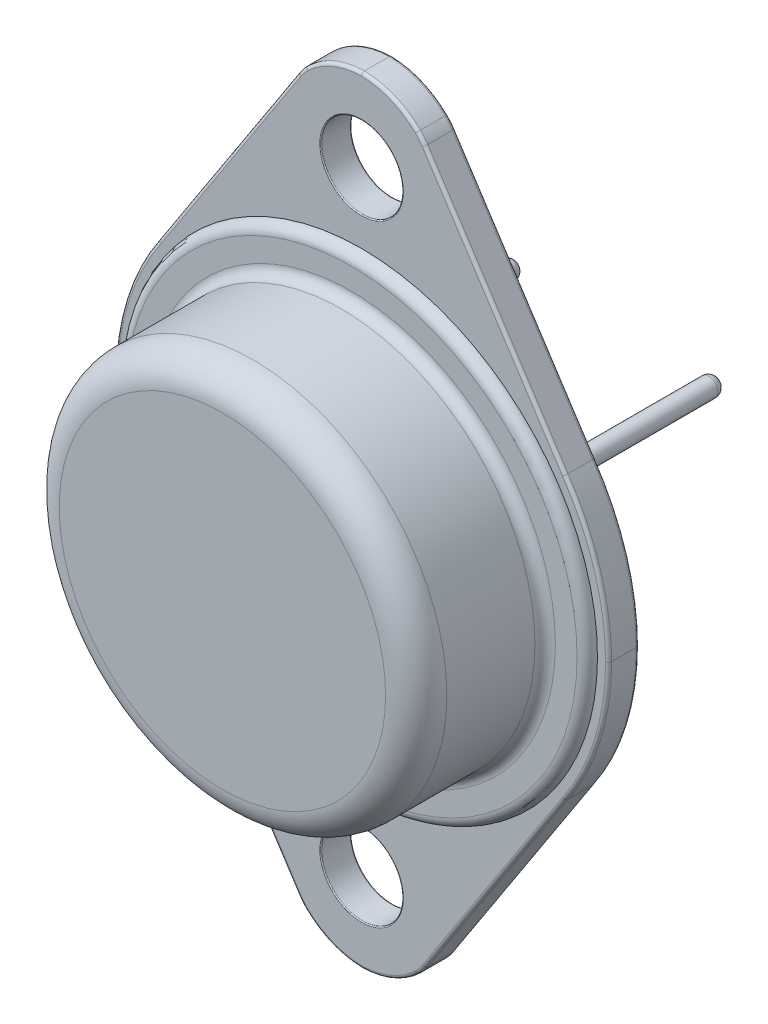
ISO-10303-21;
HEADER;
FILE_DESCRIPTION(('STEP AP214'),'2;1');
FILE_NAME('part.step','',(''),(''),'','','');
FILE_SCHEMA(('AUTOMOTIVE_DESIGN { 1 0 10303 214 1 1 1 1 }'));
ENDSEC;
DATA;
#1=APPLICATION_CONTEXT('core data for automotive mechanical design processes');
#2=APPLICATION_PROTOCOL_DEFINITION('international standard','automotive_design',2000,#1);
#3=PRODUCT_CONTEXT('',#1,'mechanical');
#4=PRODUCT('Part','Part','',(#3));
#5=PRODUCT_RELATED_PRODUCT_CATEGORY('part','',(#4));
#6=PRODUCT_DEFINITION_FORMATION('','',#4);
#7=PRODUCT_DEFINITION_CONTEXT('part definition',#1,'design');
#8=PRODUCT_DEFINITION('design','',#6,#7);
#9=PRODUCT_DEFINITION_SHAPE('','',#8);
#10=(LENGTH_UNIT() NAMED_UNIT(*) SI_UNIT(.MILLI.,.METRE.));
#11=(NAMED_UNIT(*) PLANE_ANGLE_UNIT() SI_UNIT($,.RADIAN.));
#12=(NAMED_UNIT(*) SI_UNIT($,.STERADIAN.) SOLID_ANGLE_UNIT());
#13=UNCERTAINTY_MEASURE_WITH_UNIT(LENGTH_MEASURE(1.E-05),#10,'distance_accuracy_value','');
#14=(GEOMETRIC_REPRESENTATION_CONTEXT(3) GLOBAL_UNCERTAINTY_ASSIGNED_CONTEXT((#13)) GLOBAL_UNIT_ASSIGNED_CONTEXT((#10,
#11,#12)) REPRESENTATION_CONTEXT('',''));
#15=CARTESIAN_POINT('',(0.,0.,0.));
#16=DIRECTION('',(0.,0.,1.));
#17=DIRECTION('',(1.,0.,0.));
#18=AXIS2_PLACEMENT_3D('',#15,#16,#17);
#19=CARTESIAN_POINT('',(0.,0.,8.32));
#20=DIRECTION('',(0.,0.,1.));
#21=DIRECTION('',(1.,0.,0.));
#22=AXIS2_PLACEMENT_3D('',#19,#20,#21);
#23=PLANE('',#22);
#24=CARTESIAN_POINT('',(0.,0.,8.32));
#25=DIRECTION('',(0.,0.,-1.));
#26=DIRECTION('',(1.,0.,0.));
#27=AXIS2_PLACEMENT_3D('',#24,#25,#26);
#28=CIRCLE('',#27,8.);
#29=CARTESIAN_POINT('',(8.,0.,8.32));
#30=VERTEX_POINT('',#29);
#31=EDGE_CURVE('P0_E612',#30,#30,#28,.T.);
#32=ORIENTED_EDGE('',*,*,#31,.F.);
#33=EDGE_LOOP('',(#32));
#34=FACE_BOUND('',#33,.T.);
#35=ADVANCED_FACE('P0_F40',(#34),#23,.T.);
#36=CARTESIAN_POINT('',(0.,0.,6.82));
#37=DIRECTION('',(0.,0.,-1.));
#38=DIRECTION('',(-1.,0.,0.));
#39=AXIS2_PLACEMENT_3D('',#36,#37,#38);
#40=TOROIDAL_SURFACE('',#39,8.,1.5);
#41=CARTESIAN_POINT('',(0.,0.,6.82));
#42=DIRECTION('',(0.,0.,1.));
#43=DIRECTION('',(1.,0.,0.));
#44=AXIS2_PLACEMENT_3D('',#41,#42,#43);
#45=CIRCLE('',#44,9.5);
#46=CARTESIAN_POINT('',(9.5,0.,6.82));
#47=VERTEX_POINT('',#46);
#48=EDGE_CURVE('P0_E607',#47,#47,#45,.F.);
#49=ORIENTED_EDGE('',*,*,#48,.F.);
#50=EDGE_LOOP('',(#49));
#51=FACE_BOUND('',#50,.T.);
#52=ORIENTED_EDGE('',*,*,#31,.T.);
#53=EDGE_LOOP('',(#52));
#54=FACE_BOUND('',#53,.T.);
#55=ADVANCED_FACE('P0_F639',(#51,#54),#40,.T.);
#56=CARTESIAN_POINT('',(0.,0.,2.));
#57=DIRECTION('',(0.,0.,1.));
#58=DIRECTION('',(1.,0.,0.));
#59=AXIS2_PLACEMENT_3D('',#56,#57,#58);
#60=CYLINDRICAL_SURFACE('',#59,9.5);
#61=CARTESIAN_POINT('',(0.,0.,2.5));
#62=DIRECTION('',(0.,0.,-1.));
#63=DIRECTION('',(-1.,0.,0.));
#64=AXIS2_PLACEMENT_3D('',#61,#62,#63);
#65=CIRCLE('',#64,9.5);
#66=CARTESIAN_POINT('',(-9.5,0.,2.5));
#67=VERTEX_POINT('',#66);
#68=EDGE_CURVE('P0_E602',#67,#67,#65,.T.);
#69=ORIENTED_EDGE('',*,*,#68,.F.);
#70=EDGE_LOOP('',(#69));
#71=FACE_BOUND('',#70,.T.);
#72=ORIENTED_EDGE('',*,*,#48,.T.);
#73=EDGE_LOOP('',(#72));
#74=FACE_BOUND('',#73,.T.);
#75=ADVANCED_FACE('P0_F635',(#71,#74),#60,.T.);
#76=CARTESIAN_POINT('',(0.,0.,2.5));
#77=DIRECTION('',(0.,0.,-1.));
#78=DIRECTION('',(-1.,0.,0.));
#79=AXIS2_PLACEMENT_3D('',#76,#77,#78);
#80=TOROIDAL_SURFACE('',#79,10.,0.5);
#81=CARTESIAN_POINT('',(0.,0.,2.));
#82=DIRECTION('',(0.,0.,1.));
#83=DIRECTION('',(1.,0.,0.));
#84=AXIS2_PLACEMENT_3D('',#81,#82,#83);
#85=CIRCLE('',#84,10.);
#86=CARTESIAN_POINT('',(10.,0.,2.));
#87=VERTEX_POINT('',#86);
#88=EDGE_CURVE('P0_E598',#87,#87,#85,.F.);
#89=ORIENTED_EDGE('',*,*,#88,.F.);
#90=EDGE_LOOP('',(#89));
#91=FACE_BOUND('',#90,.T.);
#92=ORIENTED_EDGE('',*,*,#68,.T.);
#93=EDGE_LOOP('',(#92));
#94=FACE_BOUND('',#93,.T.);
#95=ADVANCED_FACE('P0_F624',(#91,#94),#80,.F.);
#96=CARTESIAN_POINT('',(-1.13686837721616E-13,0.,0.));
#97=DIRECTION('',(0.,0.,1.));
#98=DIRECTION('',(1.,0.,0.));
#99=AXIS2_PLACEMENT_3D('',#96,#97,#98);
#100=PLANE('',#99);
#101=CARTESIAN_POINT('',(4.92001024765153,2.09801537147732,0.));
#102=DIRECTION('',(0.,0.,1.));
#103=DIRECTION('',(1.,0.,0.));
#104=AXIS2_PLACEMENT_3D('',#101,#102,#103);
#105=CIRCLE('',#104,0.450000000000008);
#106=CARTESIAN_POINT('',(5.37001024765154,2.09801537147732,0.));
#107=VERTEX_POINT('',#106);
#108=EDGE_CURVE('P0_E596',#107,#107,#105,.F.);
#109=ORIENTED_EDGE('',*,*,#108,.T.);
#110=EDGE_LOOP('',(#109));
#111=FACE_BOUND('',#110,.T.);
#112=ADVANCED_FACE('P0_F634',(#111),#100,.F.);
#113=CARTESIAN_POINT('',(0.,0.,2.));
#114=DIRECTION('',(0.,0.,1.));
#115=DIRECTION('',(1.,0.,0.));
#116=AXIS2_PLACEMENT_3D('',#113,#114,#115);
#117=PLANE('',#116);
#118=CARTESIAN_POINT('',(0.,0.,2.));
#119=DIRECTION('',(0.,0.,1.));
#120=DIRECTION('',(1.,0.,0.));
#121=AXIS2_PLACEMENT_3D('',#118,#119,#120);
#122=CIRCLE('',#121,11.065);
#123=CARTESIAN_POINT('',(11.065,0.,2.));
#124=VERTEX_POINT('',#123);
#125=EDGE_CURVE('P0_E686',#124,#124,#122,.T.);
#126=ORIENTED_EDGE('',*,*,#125,.T.);
#127=EDGE_LOOP('',(#126));
#128=FACE_BOUND('',#127,.T.);
#129=ORIENTED_EDGE('',*,*,#88,.T.);
#130=EDGE_LOOP('',(#129));
#131=FACE_BOUND('',#130,.T.);
#132=ADVANCED_FACE('P0_F1099',(#128,#131),#117,.T.);
#133=CARTESIAN_POINT('',(-1.13686837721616E-13,0.,0.));
#134=DIRECTION('',(0.,0.,1.));
#135=DIRECTION('',(1.,0.,0.));
#136=AXIS2_PLACEMENT_3D('',#133,#134,#135);
#137=PLANE('',#136);
#138=CARTESIAN_POINT('',(-4.95362937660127,2.09801537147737,0.));
#139=DIRECTION('',(0.,0.,1.));
#140=DIRECTION('',(1.,0.,0.));
#141=AXIS2_PLACEMENT_3D('',#138,#139,#140);
#142=CIRCLE('',#141,0.450000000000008);
#143=CARTESIAN_POINT('',(-4.50362937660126,2.09801537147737,0.));
#144=VERTEX_POINT('',#143);
#145=EDGE_CURVE('P0_E594',#144,#144,#142,.F.);
#146=ORIENTED_EDGE('',*,*,#145,.T.);
#147=EDGE_LOOP('',(#146));
#148=FACE_BOUND('',#147,.T.);
#149=ADVANCED_FACE('P0_F1090',(#148),#137,.F.);
#150=CARTESIAN_POINT('',(4.92001024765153,2.09801537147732,0.));
#151=DIRECTION('',(0.,0.,1.));
#152=DIRECTION('',(1.,0.,0.));
#153=AXIS2_PLACEMENT_3D('',#150,#151,#152);
#154=CYLINDRICAL_SURFACE('',#153,0.450000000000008);
#155=ORIENTED_EDGE('',*,*,#108,.F.);
#156=EDGE_LOOP('',(#155));
#157=FACE_BOUND('',#156,.T.);
#158=CARTESIAN_POINT('',(4.92001024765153,2.09801537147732,0.1));
#159=DIRECTION('',(0.,0.,1.));
#160=DIRECTION('',(1.,0.,0.));
#161=AXIS2_PLACEMENT_3D('',#158,#159,#160);
#162=CIRCLE('',#161,0.450000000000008);
#163=CARTESIAN_POINT('',(5.37001024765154,2.09801537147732,0.1));
#164=VERTEX_POINT('',#163);
#165=EDGE_CURVE('P0_E591',#164,#164,#162,.F.);
#166=ORIENTED_EDGE('',*,*,#165,.T.);
#167=EDGE_LOOP('',(#166));
#168=FACE_BOUND('',#167,.T.);
#169=ADVANCED_FACE('P0_F1088',(#157,#168),#154,.T.);
#170=CARTESIAN_POINT('',(-4.95362937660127,2.09801537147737,0.));
#171=DIRECTION('',(0.,0.,1.));
#172=DIRECTION('',(1.,0.,0.));
#173=AXIS2_PLACEMENT_3D('',#170,#171,#172);
#174=CYLINDRICAL_SURFACE('',#173,0.450000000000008);
#175=ORIENTED_EDGE('',*,*,#145,.F.);
#176=EDGE_LOOP('',(#175));
#177=FACE_BOUND('',#176,.T.);
#178=CARTESIAN_POINT('',(-4.95362937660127,2.09801537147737,0.1));
#179=DIRECTION('',(0.,0.,1.));
#180=DIRECTION('',(1.,0.,0.));
#181=AXIS2_PLACEMENT_3D('',#178,#179,#180);
#182=CIRCLE('',#181,0.450000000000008);
#183=CARTESIAN_POINT('',(-4.50362937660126,2.09801537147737,0.1));
#184=VERTEX_POINT('',#183);
#185=EDGE_CURVE('P0_E584',#184,#184,#182,.F.);
#186=ORIENTED_EDGE('',*,*,#185,.T.);
#187=EDGE_LOOP('',(#186));
#188=FACE_BOUND('',#187,.T.);
#189=ADVANCED_FACE('P0_F1084',(#177,#188),#174,.T.);
#190=CARTESIAN_POINT('',(4.92001024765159,2.09801537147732,0.1));
#191=DIRECTION('',(0.,0.,1.));
#192=DIRECTION('',(1.,0.,0.));
#193=AXIS2_PLACEMENT_3D('',#190,#191,#192);
#194=PLANE('',#193);
#195=CARTESIAN_POINT('',(4.92001024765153,2.09801537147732,0.1));
#196=DIRECTION('',(0.,0.,1.));
#197=DIRECTION('',(-0.000992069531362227,-0.999999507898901,0.));
#198=AXIS2_PLACEMENT_3D('',#195,#196,#197);
#199=CIRCLE('',#198,0.564110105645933);
#200=CARTESIAN_POINT('',(4.91945061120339,1.53390554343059,0.1));
#201=VERTEX_POINT('',#200);
#202=CARTESIAN_POINT('',(4.92056988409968,2.66212519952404,0.1));
#203=VERTEX_POINT('',#202);
#204=EDGE_CURVE('P0_E907',#201,#203,#199,.T.);
#205=ORIENTED_EDGE('',*,*,#204,.F.);
#206=CARTESIAN_POINT('',(4.92001024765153,2.09801537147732,0.1));
#207=DIRECTION('',(0.,0.,1.));
#208=DIRECTION('',(0.000992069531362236,0.999999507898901,0.));
#209=AXIS2_PLACEMENT_3D('',#206,#207,#208);
#210=CIRCLE('',#209,0.564110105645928);
#211=EDGE_CURVE('P0_E587',#203,#201,#210,.T.);
#212=ORIENTED_EDGE('',*,*,#211,.F.);
#213=EDGE_LOOP('',(#205,#212));
#214=FACE_BOUND('',#213,.T.);
#215=ORIENTED_EDGE('',*,*,#165,.F.);
#216=EDGE_LOOP('',(#215));
#217=FACE_BOUND('',#216,.T.);
#218=ADVANCED_FACE('P0_F1081',(#214,#217),#194,.F.);
#219=CARTESIAN_POINT('',(1.00515440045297,16.0910954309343,0.));
#220=DIRECTION('',(0.,0.,1.));
#221=DIRECTION('',(1.,0.,0.));
#222=AXIS2_PLACEMENT_3D('',#219,#220,#221);
#223=CYLINDRICAL_SURFACE('',#222,2.50000000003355);
#224=DIRECTION('',(0.,0.,1.));
#225=VECTOR('',#224,1.);
#226=CARTESIAN_POINT('',(3.09971559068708,17.455944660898,0.));
#227=LINE('',#226,#225);
#228=CARTESIAN_POINT('',(3.09971559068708,17.455944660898,0.15));
#229=VERTEX_POINT('',#228);
#230=CARTESIAN_POINT('',(3.09971559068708,17.455944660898,1.35));
#231=VERTEX_POINT('',#230);
#232=EDGE_CURVE('P0_E901',#229,#231,#227,.T.);
#233=ORIENTED_EDGE('',*,*,#232,.F.);
#234=CARTESIAN_POINT('',(1.00515440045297,16.0910954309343,0.15));
#235=DIRECTION('',(0.,0.,1.));
#236=DIRECTION('',(1.,0.,0.));
#237=AXIS2_PLACEMENT_3D('',#234,#235,#236);
#238=CIRCLE('',#237,2.50000000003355);
#239=CARTESIAN_POINT('',(2.74443590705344,17.8868960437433,0.15));
#240=VERTEX_POINT('',#239);
#241=EDGE_CURVE('P0_E957',#229,#240,#238,.T.);
#242=ORIENTED_EDGE('',*,*,#241,.T.);
#243=DIRECTION('',(0.,0.,1.));
#244=VECTOR('',#243,1.);
#245=CARTESIAN_POINT('',(2.74443590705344,17.8868960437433,0.));
#246=LINE('',#245,#244);
#247=CARTESIAN_POINT('',(2.74443590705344,17.8868960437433,1.35));
#248=VERTEX_POINT('',#247);
#249=EDGE_CURVE('P0_E947',#248,#240,#246,.F.);
#250=ORIENTED_EDGE('',*,*,#249,.F.);
#251=CARTESIAN_POINT('',(1.00515440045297,16.0910954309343,1.35));
#252=DIRECTION('',(0.,0.,1.));
#253=DIRECTION('',(1.,0.,0.));
#254=AXIS2_PLACEMENT_3D('',#251,#252,#253);
#255=CIRCLE('',#254,2.50000000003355);
#256=EDGE_CURVE('P0_E838',#248,#231,#255,.F.);
#257=ORIENTED_EDGE('',*,*,#256,.T.);
#258=EDGE_LOOP('',(#233,#242,#250,#257));
#259=FACE_BOUND('',#258,.T.);
#260=ADVANCED_FACE('P0_F955',(#259),#223,.T.);
#261=CARTESIAN_POINT('',(-1.00515440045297,16.0910954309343,0.));
#262=DIRECTION('',(0.,0.,1.));
#263=DIRECTION('',(1.,0.,0.));
#264=AXIS2_PLACEMENT_3D('',#261,#262,#263);
#265=CYLINDRICAL_SURFACE('',#264,2.50000000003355);
#266=DIRECTION('',(0.,0.,1.));
#267=VECTOR('',#266,1.);
#268=CARTESIAN_POINT('',(-2.74443590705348,17.8868960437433,0.));
#269=LINE('',#268,#267);
#270=CARTESIAN_POINT('',(-2.74443590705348,17.8868960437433,0.15));
#271=VERTEX_POINT('',#270);
#272=CARTESIAN_POINT('',(-2.74443590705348,17.8868960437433,1.35));
#273=VERTEX_POINT('',#272);
#274=EDGE_CURVE('P0_E959',#271,#273,#269,.T.);
#275=ORIENTED_EDGE('',*,*,#274,.F.);
#276=CARTESIAN_POINT('',(-1.00515440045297,16.0910954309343,0.15));
#277=DIRECTION('',(0.,0.,1.));
#278=DIRECTION('',(1.,0.,0.));
#279=AXIS2_PLACEMENT_3D('',#276,#277,#278);
#280=CIRCLE('',#279,2.50000000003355);
#281=CARTESIAN_POINT('',(-3.09971559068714,17.455944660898,0.15));
#282=VERTEX_POINT('',#281);
#283=EDGE_CURVE('P0_E361',#271,#282,#280,.T.);
#284=ORIENTED_EDGE('',*,*,#283,.T.);
#285=DIRECTION('',(0.,0.,1.));
#286=VECTOR('',#285,1.);
#287=CARTESIAN_POINT('',(-3.09971559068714,17.455944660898,0.));
#288=LINE('',#287,#286);
#289=CARTESIAN_POINT('',(-3.09971559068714,17.455944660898,1.35));
#290=VERTEX_POINT('',#289);
#291=EDGE_CURVE('P0_E355',#290,#282,#288,.F.);
#292=ORIENTED_EDGE('',*,*,#291,.F.);
#293=CARTESIAN_POINT('',(-1.00515440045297,16.0910954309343,1.35));
#294=DIRECTION('',(0.,0.,1.));
#295=DIRECTION('',(1.,0.,0.));
#296=AXIS2_PLACEMENT_3D('',#293,#294,#295);
#297=CIRCLE('',#296,2.50000000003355);
#298=EDGE_CURVE('P0_E744',#290,#273,#297,.F.);
#299=ORIENTED_EDGE('',*,*,#298,.T.);
#300=EDGE_LOOP('',(#275,#284,#292,#299));
#301=FACE_BOUND('',#300,.T.);
#302=ADVANCED_FACE('P0_F984',(#301),#265,.T.);
#303=CARTESIAN_POINT('',(-1.00515440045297,-16.0910954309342,0.));
#304=DIRECTION('',(0.,0.,1.));
#305=DIRECTION('',(1.,0.,0.));
#306=AXIS2_PLACEMENT_3D('',#303,#304,#305);
#307=CYLINDRICAL_SURFACE('',#306,2.50000000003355);
#308=DIRECTION('',(0.,0.,1.));
#309=VECTOR('',#308,1.);
#310=CARTESIAN_POINT('',(-3.09971559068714,-17.455944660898,0.));
#311=LINE('',#310,#309);
#312=CARTESIAN_POINT('',(-3.09971559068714,-17.455944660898,0.15));
#313=VERTEX_POINT('',#312);
#314=CARTESIAN_POINT('',(-3.09971559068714,-17.455944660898,1.35));
#315=VERTEX_POINT('',#314);
#316=EDGE_CURVE('P0_E344',#313,#315,#311,.T.);
#317=ORIENTED_EDGE('',*,*,#316,.F.);
#318=CARTESIAN_POINT('',(-1.00515440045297,-16.0910954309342,0.15));
#319=DIRECTION('',(0.,0.,1.));
#320=DIRECTION('',(1.,0.,0.));
#321=AXIS2_PLACEMENT_3D('',#318,#319,#320);
#322=CIRCLE('',#321,2.50000000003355);
#323=CARTESIAN_POINT('',(-2.74443590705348,-17.8868960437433,0.15));
#324=VERTEX_POINT('',#323);
#325=EDGE_CURVE('P0_E406',#313,#324,#322,.T.);
#326=ORIENTED_EDGE('',*,*,#325,.T.);
#327=DIRECTION('',(0.,0.,1.));
#328=VECTOR('',#327,1.);
#329=CARTESIAN_POINT('',(-2.74443590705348,-17.8868960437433,0.));
#330=LINE('',#329,#328);
#331=CARTESIAN_POINT('',(-2.74443590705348,-17.8868960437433,1.35));
#332=VERTEX_POINT('',#331);
#333=EDGE_CURVE('P0_E340',#332,#324,#330,.F.);
#334=ORIENTED_EDGE('',*,*,#333,.F.);
#335=CARTESIAN_POINT('',(-1.00515440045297,-16.0910954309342,1.35));
#336=DIRECTION('',(0.,0.,1.));
#337=DIRECTION('',(1.,0.,0.));
#338=AXIS2_PLACEMENT_3D('',#335,#336,#337);
#339=CIRCLE('',#338,2.50000000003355);
#340=EDGE_CURVE('P0_E854',#332,#315,#339,.F.);
#341=ORIENTED_EDGE('',*,*,#340,.T.);
#342=EDGE_LOOP('',(#317,#326,#334,#341));
#343=FACE_BOUND('',#342,.T.);
#344=ADVANCED_FACE('P0_F711',(#343),#307,.T.);
#345=CARTESIAN_POINT('',(1.00515440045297,-16.0910954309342,0.));
#346=DIRECTION('',(0.,0.,1.));
#347=DIRECTION('',(1.,0.,0.));
#348=AXIS2_PLACEMENT_3D('',#345,#346,#347);
#349=CYLINDRICAL_SURFACE('',#348,2.50000000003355);
#350=DIRECTION('',(0.,0.,1.));
#351=VECTOR('',#350,1.);
#352=CARTESIAN_POINT('',(2.74443590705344,-17.8868960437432,0.));
#353=LINE('',#352,#351);
#354=CARTESIAN_POINT('',(2.74443590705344,-17.8868960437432,0.15));
#355=VERTEX_POINT('',#354);
#356=CARTESIAN_POINT('',(2.74443590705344,-17.8868960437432,1.35));
#357=VERTEX_POINT('',#356);
#358=EDGE_CURVE('P0_E336',#355,#357,#353,.T.);
#359=ORIENTED_EDGE('',*,*,#358,.F.);
#360=CARTESIAN_POINT('',(1.00515440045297,-16.0910954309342,0.15));
#361=DIRECTION('',(0.,0.,1.));
#362=DIRECTION('',(1.,0.,0.));
#363=AXIS2_PLACEMENT_3D('',#360,#361,#362);
#364=CIRCLE('',#363,2.50000000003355);
#365=CARTESIAN_POINT('',(3.09971559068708,-17.455944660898,0.15));
#366=VERTEX_POINT('',#365);
#367=EDGE_CURVE('P0_E414',#355,#366,#364,.T.);
#368=ORIENTED_EDGE('',*,*,#367,.T.);
#369=DIRECTION('',(0.,0.,1.));
#370=VECTOR('',#369,1.);
#371=CARTESIAN_POINT('',(3.09971559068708,-17.455944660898,0.));
#372=LINE('',#371,#370);
#373=CARTESIAN_POINT('',(3.09971559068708,-17.455944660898,1.35));
#374=VERTEX_POINT('',#373);
#375=EDGE_CURVE('P0_E333',#374,#366,#372,.F.);
#376=ORIENTED_EDGE('',*,*,#375,.F.);
#377=CARTESIAN_POINT('',(1.00515440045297,-16.0910954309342,1.35));
#378=DIRECTION('',(0.,0.,1.));
#379=DIRECTION('',(1.,0.,0.));
#380=AXIS2_PLACEMENT_3D('',#377,#378,#379);
#381=CIRCLE('',#380,2.50000000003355);
#382=EDGE_CURVE('P0_E829',#374,#357,#381,.F.);
#383=ORIENTED_EDGE('',*,*,#382,.T.);
#384=EDGE_LOOP('',(#359,#368,#376,#383));
#385=FACE_BOUND('',#384,.T.);
#386=ADVANCED_FACE('P0_F706',(#385),#349,.T.);
#387=CARTESIAN_POINT('',(0.,0.,1.5));
#388=DIRECTION('',(0.,0.,1.));
#389=DIRECTION('',(1.,0.,0.));
#390=AXIS2_PLACEMENT_3D('',#387,#388,#389);
#391=PLANE('',#390);
#392=CARTESIAN_POINT('',(0.,15.,1.5));
#393=DIRECTION('',(0.,0.,1.));
#394=DIRECTION('',(1.,0.,0.));
#395=AXIS2_PLACEMENT_3D('',#392,#393,#394);
#396=CIRCLE('',#395,2.05);
#397=CARTESIAN_POINT('',(2.05,15.,1.5));
#398=VERTEX_POINT('',#397);
#399=EDGE_CURVE('P0_E716',#398,#398,#396,.F.);
#400=ORIENTED_EDGE('',*,*,#399,.T.);
#401=EDGE_LOOP('',(#400));
#402=FACE_BOUND('',#401,.T.);
#403=CARTESIAN_POINT('',(0.,-15.,1.5));
#404=DIRECTION('',(0.,0.,1.));
#405=DIRECTION('',(1.,0.,0.));
#406=AXIS2_PLACEMENT_3D('',#403,#404,#405);
#407=CIRCLE('',#406,2.05);
#408=CARTESIAN_POINT('',(2.04999999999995,-15.,1.5));
#409=VERTEX_POINT('',#408);
#410=EDGE_CURVE('P0_E422',#409,#409,#407,.F.);
#411=ORIENTED_EDGE('',*,*,#410,.T.);
#412=EDGE_LOOP('',(#411));
#413=FACE_BOUND('',#412,.T.);
#414=DIRECTION('',(0.545936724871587,0.837826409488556,0.));
#415=VECTOR('',#414,1.);
#416=CARTESIAN_POINT('',(-10.0345336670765,6.5386103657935,1.5));
#417=LINE('',#416,#415);
#418=CARTESIAN_POINT('',(-2.97404191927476,17.3740537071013,1.5));
#419=VERTEX_POINT('',#418);
#420=CARTESIAN_POINT('',(-9.84649981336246,6.82717810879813,1.5));
#421=VERTEX_POINT('',#420);
#422=EDGE_CURVE('P0_E721',#419,#421,#417,.F.);
#423=ORIENTED_EDGE('',*,*,#422,.T.);
#424=CARTESIAN_POINT('',(0.148617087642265,-0.0121638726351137,1.5));
#425=DIRECTION('',(0.,0.,1.));
#426=DIRECTION('',(1.,0.,0.));
#427=AXIS2_PLACEMENT_3D('',#424,#425,#426);
#428=CIRCLE('',#427,12.1111089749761);
#429=CARTESIAN_POINT('',(-11.9624856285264,-0.000148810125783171,1.5));
#430=VERTEX_POINT('',#429);
#431=EDGE_CURVE('P0_E723',#421,#430,#428,.T.);
#432=ORIENTED_EDGE('',*,*,#431,.T.);
#433=CARTESIAN_POINT('',(0.148617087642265,0.0121638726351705,1.5));
#434=DIRECTION('',(0.,0.,1.));
#435=DIRECTION('',(1.,0.,0.));
#436=AXIS2_PLACEMENT_3D('',#433,#434,#435);
#437=CIRCLE('',#436,12.1111089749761);
#438=CARTESIAN_POINT('',(-9.8464998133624,-6.82717810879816,1.5));
#439=VERTEX_POINT('',#438);
#440=EDGE_CURVE('P0_E732',#430,#439,#437,.T.);
#441=ORIENTED_EDGE('',*,*,#440,.T.);
#442=DIRECTION('',(-0.545936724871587,0.837826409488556,0.));
#443=VECTOR('',#442,1.);
#444=CARTESIAN_POINT('',(-10.0345336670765,-6.53861036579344,1.5));
#445=LINE('',#444,#443);
#446=CARTESIAN_POINT('',(-2.97404162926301,-17.3740541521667,1.5));
#447=VERTEX_POINT('',#446);
#448=EDGE_CURVE('P0_E733',#439,#447,#445,.F.);
#449=ORIENTED_EDGE('',*,*,#448,.T.);
#450=CARTESIAN_POINT('',(-1.00515440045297,-16.0910954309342,1.5));
#451=DIRECTION('',(0.,0.,1.));
#452=DIRECTION('',(1.,0.,0.));
#453=AXIS2_PLACEMENT_3D('',#450,#451,#452);
#454=CIRCLE('',#453,2.35000000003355);
#455=CARTESIAN_POINT('',(-2.640079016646,-17.7791480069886,1.5));
#456=VERTEX_POINT('',#455);
#457=EDGE_CURVE('P0_E931',#447,#456,#454,.T.);
#458=ORIENTED_EDGE('',*,*,#457,.T.);
#459=CARTESIAN_POINT('',(0.0724304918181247,-14.9784937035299,1.5));
#460=DIRECTION('',(0.,0.,1.));
#461=DIRECTION('',(1.,0.,0.));
#462=AXIS2_PLACEMENT_3D('',#459,#460,#461);
#463=CIRCLE('',#462,3.8988937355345);
#464=CARTESIAN_POINT('',(0.,-18.8767146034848,1.5));
#465=VERTEX_POINT('',#464);
#466=EDGE_CURVE('P0_E935',#456,#465,#463,.T.);
#467=ORIENTED_EDGE('',*,*,#466,.T.);
#468=CARTESIAN_POINT('',(-0.0724304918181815,-14.9784937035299,1.5));
#469=DIRECTION('',(0.,0.,1.));
#470=DIRECTION('',(1.,0.,0.));
#471=AXIS2_PLACEMENT_3D('',#468,#469,#470);
#472=CIRCLE('',#471,3.8988937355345);
#473=CARTESIAN_POINT('',(2.64007901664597,-17.7791480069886,1.5));
#474=VERTEX_POINT('',#473);
#475=EDGE_CURVE('P0_E834',#465,#474,#472,.T.);
#476=ORIENTED_EDGE('',*,*,#475,.T.);
#477=CARTESIAN_POINT('',(1.00515440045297,-16.0910954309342,1.5));
#478=DIRECTION('',(0.,0.,1.));
#479=DIRECTION('',(1.,0.,0.));
#480=AXIS2_PLACEMENT_3D('',#477,#478,#479);
#481=CIRCLE('',#480,2.35000000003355);
#482=CARTESIAN_POINT('',(2.97404191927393,-17.3740537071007,1.5));
#483=VERTEX_POINT('',#482);
#484=EDGE_CURVE('P0_E831',#474,#483,#481,.T.);
#485=ORIENTED_EDGE('',*,*,#484,.T.);
#486=DIRECTION('',(-0.545936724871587,-0.837826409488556,0.));
#487=VECTOR('',#486,1.);
#488=CARTESIAN_POINT('',(10.0345336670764,-6.53861036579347,1.5));
#489=LINE('',#488,#487);
#490=CARTESIAN_POINT('',(9.8464998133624,-6.82717810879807,1.5));
#491=VERTEX_POINT('',#490);
#492=EDGE_CURVE('P0_E922',#483,#491,#489,.F.);
#493=ORIENTED_EDGE('',*,*,#492,.T.);
#494=CARTESIAN_POINT('',(-0.148617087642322,0.0121638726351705,1.5));
#495=DIRECTION('',(0.,0.,1.));
#496=DIRECTION('',(1.,0.,0.));
#497=AXIS2_PLACEMENT_3D('',#494,#495,#496);
#498=CIRCLE('',#497,12.1111089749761);
#499=CARTESIAN_POINT('',(11.9624856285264,-0.000148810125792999,1.5));
#500=VERTEX_POINT('',#499);
#501=EDGE_CURVE('P0_E914',#491,#500,#498,.T.);
#502=ORIENTED_EDGE('',*,*,#501,.T.);
#503=CARTESIAN_POINT('',(-0.148617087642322,-0.0121638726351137,1.5));
#504=DIRECTION('',(0.,0.,1.));
#505=DIRECTION('',(1.,0.,0.));
#506=AXIS2_PLACEMENT_3D('',#503,#504,#505);
#507=CIRCLE('',#506,12.1111089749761);
#508=CARTESIAN_POINT('',(9.84649981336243,6.82717810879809,1.5));
#509=VERTEX_POINT('',#508);
#510=EDGE_CURVE('P0_E911',#500,#509,#507,.T.);
#511=ORIENTED_EDGE('',*,*,#510,.T.);
#512=DIRECTION('',(0.545936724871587,-0.837826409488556,0.));
#513=VECTOR('',#512,1.);
#514=CARTESIAN_POINT('',(10.0345336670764,6.53861036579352,1.5));
#515=LINE('',#514,#513);
#516=CARTESIAN_POINT('',(2.97404191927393,17.3740537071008,1.5));
#517=VERTEX_POINT('',#516);
#518=EDGE_CURVE('P0_E891',#509,#517,#515,.F.);
#519=ORIENTED_EDGE('',*,*,#518,.T.);
#520=CARTESIAN_POINT('',(1.00515440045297,16.0910954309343,1.5));
#521=DIRECTION('',(0.,0.,1.));
#522=DIRECTION('',(1.,0.,0.));
#523=AXIS2_PLACEMENT_3D('',#520,#521,#522);
#524=CIRCLE('',#523,2.35000000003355);
#525=CARTESIAN_POINT('',(2.64007901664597,17.7791480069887,1.5));
#526=VERTEX_POINT('',#525);
#527=EDGE_CURVE('P0_E888',#517,#526,#524,.T.);
#528=ORIENTED_EDGE('',*,*,#527,.T.);
#529=CARTESIAN_POINT('',(-0.0724304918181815,14.97849370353,1.5));
#530=DIRECTION('',(0.,0.,1.));
#531=DIRECTION('',(1.,0.,0.));
#532=AXIS2_PLACEMENT_3D('',#529,#530,#531);
#533=CIRCLE('',#532,3.8988937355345);
#534=CARTESIAN_POINT('',(0.,18.8767146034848,1.5));
#535=VERTEX_POINT('',#534);
#536=EDGE_CURVE('P0_E1049',#526,#535,#533,.T.);
#537=ORIENTED_EDGE('',*,*,#536,.T.);
#538=CARTESIAN_POINT('',(0.0724304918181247,14.97849370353,1.5));
#539=DIRECTION('',(0.,0.,1.));
#540=DIRECTION('',(1.,0.,0.));
#541=AXIS2_PLACEMENT_3D('',#538,#539,#540);
#542=CIRCLE('',#541,3.8988937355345);
#543=CARTESIAN_POINT('',(-2.640079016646,17.7791480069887,1.5));
#544=VERTEX_POINT('',#543);
#545=EDGE_CURVE('P0_E1048',#535,#544,#542,.T.);
#546=ORIENTED_EDGE('',*,*,#545,.T.);
#547=CARTESIAN_POINT('',(-1.00515440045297,16.0910954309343,1.5));
#548=DIRECTION('',(0.,0.,1.));
#549=DIRECTION('',(1.,0.,0.));
#550=AXIS2_PLACEMENT_3D('',#547,#548,#549);
#551=CIRCLE('',#550,2.35000000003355);
#552=EDGE_CURVE('P0_E727',#544,#419,#551,.T.);
#553=ORIENTED_EDGE('',*,*,#552,.T.);
#554=EDGE_LOOP('',(#423,#432,#441,#449,#458,#467,#476,#485,#493,#502,#511,#519,#528,#537,#546,#553));
#555=FACE_BOUND('',#554,.T.);
#556=CARTESIAN_POINT('',(0.,0.,1.5));
#557=DIRECTION('',(0.,0.,1.));
#558=DIRECTION('',(1.,0.,0.));
#559=AXIS2_PLACEMENT_3D('',#556,#557,#558);
#560=CIRCLE('',#559,11.565);
#561=CARTESIAN_POINT('',(11.565,0.,1.5));
#562=VERTEX_POINT('',#561);
#563=EDGE_CURVE('P0_E588',#562,#562,#560,.F.);
#564=ORIENTED_EDGE('',*,*,#563,.T.);
#565=EDGE_LOOP('',(#564));
#566=FACE_BOUND('',#565,.T.);
#567=ADVANCED_FACE('P0_F295',(#402,#413,#555,#566),#391,.T.);
#568=CARTESIAN_POINT('',(-4.95362937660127,2.09801537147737,0.1));
#569=DIRECTION('',(0.,0.,1.));
#570=DIRECTION('',(1.,0.,0.));
#571=AXIS2_PLACEMENT_3D('',#568,#569,#570);
#572=PLANE('',#571);
#573=CARTESIAN_POINT('',(-4.95362937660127,2.09801537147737,0.1));
#574=DIRECTION('',(0.,0.,1.));
#575=DIRECTION('',(-0.000992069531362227,-0.999999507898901,0.));
#576=AXIS2_PLACEMENT_3D('',#573,#574,#575);
#577=CIRCLE('',#576,0.564110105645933);
#578=CARTESIAN_POINT('',(-4.95418901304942,1.53390554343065,0.1));
#579=VERTEX_POINT('',#578);
#580=CARTESIAN_POINT('',(-4.95306974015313,2.6621251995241,0.1));
#581=VERTEX_POINT('',#580);
#582=EDGE_CURVE('P0_E266',#579,#581,#577,.T.);
#583=ORIENTED_EDGE('',*,*,#582,.F.);
#584=CARTESIAN_POINT('',(-4.95362937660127,2.09801537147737,0.1));
#585=DIRECTION('',(0.,0.,1.));
#586=DIRECTION('',(0.000992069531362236,0.999999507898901,0.));
#587=AXIS2_PLACEMENT_3D('',#584,#585,#586);
#588=CIRCLE('',#587,0.564110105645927);
#589=EDGE_CURVE('P0_E262',#581,#579,#588,.T.);
#590=ORIENTED_EDGE('',*,*,#589,.F.);
#591=EDGE_LOOP('',(#583,#590));
#592=FACE_BOUND('',#591,.T.);
#593=ORIENTED_EDGE('',*,*,#185,.F.);
#594=EDGE_LOOP('',(#593));
#595=FACE_BOUND('',#594,.T.);
#596=ADVANCED_FACE('P0_F274',(#592,#595),#572,.F.);
#597=CARTESIAN_POINT('',(4.91945061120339,1.53390554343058,-0.9));
#598=DIRECTION('',(0.999999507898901,-0.000992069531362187,0.));
#599=DIRECTION('',(-0.000992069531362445,-0.999999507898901,0.));
#600=AXIS2_PLACEMENT_3D('',#597,#598,#599);
#601=CIRCLE('',#600,1.);
#602=TRIMMED_CURVE('',#601,(PARAMETER_VALUE(-2.17015143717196)),
(PARAMETER_VALUE(2.17015143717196)),.T.,.PARAMETER.);
#603=CARTESIAN_POINT('',(4.92001024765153,2.09801537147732,-0.9));
#604=DIRECTION('',(0.,0.,-1.));
#605=AXIS1_PLACEMENT('',#603,#604);
#606=SURFACE_OF_REVOLUTION('',#602,#605);
#607=CARTESIAN_POINT('',(4.92001024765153,2.09801537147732,0.));
#608=DIRECTION('',(0.,0.,-1.));
#609=DIRECTION('',(-1.,0.,0.));
#610=AXIS2_PLACEMENT_3D('',#607,#608,#609);
#611=CIRCLE('',#610,1.);
#612=CARTESIAN_POINT('',(3.92001024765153,2.09801537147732,0.));
#613=VERTEX_POINT('',#612);
#614=EDGE_CURVE('P0_E276',#613,#613,#611,.T.);
#615=ORIENTED_EDGE('',*,*,#614,.T.);
#616=EDGE_LOOP('',(#615));
#617=FACE_BOUND('',#616,.T.);
#618=ORIENTED_EDGE('',*,*,#204,.T.);
#619=ORIENTED_EDGE('',*,*,#211,.T.);
#620=EDGE_LOOP('',(#618,#619));
#621=FACE_BOUND('',#620,.T.);
#622=ADVANCED_FACE('P0_F294',(#617,#621),#606,.F.);
#623=CARTESIAN_POINT('',(0.,15.,0.));
#624=DIRECTION('',(0.,0.,1.));
#625=DIRECTION('',(1.,0.,0.));
#626=AXIS2_PLACEMENT_3D('',#623,#624,#625);
#627=CYLINDRICAL_SURFACE('',#626,2.);
#628=CARTESIAN_POINT('',(0.,15.,0.05));
#629=DIRECTION('',(0.,0.,1.));
#630=DIRECTION('',(1.,0.,0.));
#631=AXIS2_PLACEMENT_3D('',#628,#629,#630);
#632=CIRCLE('',#631,2.);
#633=CARTESIAN_POINT('',(2.,15.,0.05));
#634=VERTEX_POINT('',#633);
#635=EDGE_CURVE('P0_E1713',#634,#634,#632,.F.);
#636=ORIENTED_EDGE('',*,*,#635,.T.);
#637=EDGE_LOOP('',(#636));
#638=FACE_BOUND('',#637,.T.);
#639=CARTESIAN_POINT('',(0.,15.,1.45));
#640=DIRECTION('',(0.,0.,1.));
#641=DIRECTION('',(1.,0.,0.));
#642=AXIS2_PLACEMENT_3D('',#639,#640,#641);
#643=CIRCLE('',#642,2.);
#644=CARTESIAN_POINT('',(2.,15.,1.45));
#645=VERTEX_POINT('',#644);
#646=EDGE_CURVE('P0_E1716',#645,#645,#643,.T.);
#647=ORIENTED_EDGE('',*,*,#646,.T.);
#648=EDGE_LOOP('',(#647));
#649=FACE_BOUND('',#648,.T.);
#650=ADVANCED_FACE('P0_F1208',(#638,#649),#627,.F.);
#651=CARTESIAN_POINT('',(0.,-15.,0.));
#652=DIRECTION('',(0.,0.,1.));
#653=DIRECTION('',(1.,0.,0.));
#654=AXIS2_PLACEMENT_3D('',#651,#652,#653);
#655=CYLINDRICAL_SURFACE('',#654,2.);
#656=CARTESIAN_POINT('',(0.,-15.,0.05));
#657=DIRECTION('',(0.,0.,1.));
#658=DIRECTION('',(1.,0.,0.));
#659=AXIS2_PLACEMENT_3D('',#656,#657,#658);
#660=CIRCLE('',#659,2.);
#661=CARTESIAN_POINT('',(1.99999999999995,-15.,0.05));
#662=VERTEX_POINT('',#661);
#663=EDGE_CURVE('P0_E11',#662,#662,#660,.F.);
#664=ORIENTED_EDGE('',*,*,#663,.T.);
#665=EDGE_LOOP('',(#664));
#666=FACE_BOUND('',#665,.T.);
#667=CARTESIAN_POINT('',(0.,-15.,1.45));
#668=DIRECTION('',(0.,0.,1.));
#669=DIRECTION('',(1.,0.,0.));
#670=AXIS2_PLACEMENT_3D('',#667,#668,#669);
#671=CIRCLE('',#670,2.);
#672=CARTESIAN_POINT('',(1.99999999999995,-15.,1.45));
#673=VERTEX_POINT('',#672);
#674=EDGE_CURVE('P0_E1719',#673,#673,#671,.T.);
#675=ORIENTED_EDGE('',*,*,#674,.T.);
#676=EDGE_LOOP('',(#675));
#677=FACE_BOUND('',#676,.T.);
#678=ADVANCED_FACE('P0_F1191',(#666,#677),#655,.F.);
#679=CARTESIAN_POINT('',(-0.148617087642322,-0.0121638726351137,0.));
#680=DIRECTION('',(0.,0.,1.));
#681=DIRECTION('',(1.,0.,0.));
#682=AXIS2_PLACEMENT_3D('',#679,#680,#681);
#683=CYLINDRICAL_SURFACE('',#682,12.2611089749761);
#684=DIRECTION('',(0.,0.,1.));
#685=VECTOR('',#684,1.);
#686=CARTESIAN_POINT('',(12.1124858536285,0.,0.));
#687=LINE('',#686,#685);
#688=CARTESIAN_POINT('',(12.1124858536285,0.,0.15));
#689=VERTEX_POINT('',#688);
#690=CARTESIAN_POINT('',(12.1124858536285,0.,1.35));
#691=VERTEX_POINT('',#690);
#692=EDGE_CURVE('P0_E270',#689,#691,#687,.T.);
#693=ORIENTED_EDGE('',*,*,#692,.F.);
#694=CARTESIAN_POINT('',(-0.148617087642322,-0.0121638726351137,0.15));
#695=DIRECTION('',(0.,0.,1.));
#696=DIRECTION('',(1.,0.,0.));
#697=AXIS2_PLACEMENT_3D('',#694,#695,#696);
#698=CIRCLE('',#697,12.2611089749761);
#699=CARTESIAN_POINT('',(9.97125192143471,6.91048334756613,0.15));
#700=VERTEX_POINT('',#699);
#701=EDGE_CURVE('P0_E417',#689,#700,#698,.T.);
#702=ORIENTED_EDGE('',*,*,#701,.T.);
#703=DIRECTION('',(0.,0.,1.));
#704=VECTOR('',#703,1.);
#705=CARTESIAN_POINT('',(9.97125192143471,6.91048334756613,0.));
#706=LINE('',#705,#704);
#707=CARTESIAN_POINT('',(9.97125192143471,6.91048334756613,1.35));
#708=VERTEX_POINT('',#707);
#709=EDGE_CURVE('P0_E898',#708,#700,#706,.F.);
#710=ORIENTED_EDGE('',*,*,#709,.F.);
#711=CARTESIAN_POINT('',(-0.148617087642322,-0.0121638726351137,1.35));
#712=DIRECTION('',(0.,0.,1.));
#713=DIRECTION('',(1.,0.,0.));
#714=AXIS2_PLACEMENT_3D('',#711,#712,#713);
#715=CIRCLE('',#714,12.2611089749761);
#716=EDGE_CURVE('P0_E859',#708,#691,#715,.F.);
#717=ORIENTED_EDGE('',*,*,#716,.T.);
#718=EDGE_LOOP('',(#693,#702,#710,#717));
#719=FACE_BOUND('',#718,.T.);
#720=ADVANCED_FACE('P0_F904',(#719),#683,.T.);
#721=CARTESIAN_POINT('',(3.09971559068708,17.455944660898,0.));
#722=DIRECTION('',(0.837826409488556,0.545936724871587,0.));
#723=DIRECTION('',(-0.545936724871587,0.837826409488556,0.));
#724=AXIS2_PLACEMENT_3D('',#721,#722,#723);
#725=PLANE('',#724);
#726=ORIENTED_EDGE('',*,*,#709,.T.);
#727=DIRECTION('',(0.545936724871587,-0.837826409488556,0.));
#728=VECTOR('',#727,1.);
#729=CARTESIAN_POINT('',(10.1602076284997,6.62050087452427,0.15));
#730=LINE('',#729,#728);
#731=EDGE_CURVE('P0_E965',#700,#229,#730,.F.);
#732=ORIENTED_EDGE('',*,*,#731,.T.);
#733=ORIENTED_EDGE('',*,*,#232,.T.);
#734=DIRECTION('',(0.545936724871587,-0.837826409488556,0.));
#735=VECTOR('',#734,1.);
#736=CARTESIAN_POINT('',(3.09971559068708,17.455944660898,1.35));
#737=LINE('',#736,#735);
#738=EDGE_CURVE('P0_E857',#231,#708,#737,.T.);
#739=ORIENTED_EDGE('',*,*,#738,.T.);
#740=EDGE_LOOP('',(#726,#732,#733,#739));
#741=FACE_BOUND('',#740,.T.);
#742=ADVANCED_FACE('P0_F896',(#741),#725,.T.);
#743=CARTESIAN_POINT('',(-0.0724304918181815,14.97849370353,0.));
#744=DIRECTION('',(0.,0.,1.));
#745=DIRECTION('',(1.,0.,0.));
#746=AXIS2_PLACEMENT_3D('',#743,#744,#745);
#747=CYLINDRICAL_SURFACE('',#746,4.0488937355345);
#748=ORIENTED_EDGE('',*,*,#249,.T.);
#749=CARTESIAN_POINT('',(-0.0724304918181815,14.97849370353,0.15));
#750=DIRECTION('',(0.,0.,1.));
#751=DIRECTION('',(1.,0.,0.));
#752=AXIS2_PLACEMENT_3D('',#749,#750,#751);
#753=CIRCLE('',#752,4.0488937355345);
#754=CARTESIAN_POINT('',(0.,19.0267395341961,0.15));
#755=VERTEX_POINT('',#754);
#756=EDGE_CURVE('P0_E969',#240,#755,#753,.T.);
#757=ORIENTED_EDGE('',*,*,#756,.T.);
#758=DIRECTION('',(0.,0.,1.));
#759=VECTOR('',#758,1.);
#760=CARTESIAN_POINT('',(0.,19.0267395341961,0.));
#761=LINE('',#760,#759);
#762=CARTESIAN_POINT('',(0.,19.0267395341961,1.35));
#763=VERTEX_POINT('',#762);
#764=EDGE_CURVE('P0_E950',#763,#755,#761,.F.);
#765=ORIENTED_EDGE('',*,*,#764,.F.);
#766=CARTESIAN_POINT('',(-0.0724304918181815,14.97849370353,1.35));
#767=DIRECTION('',(0.,0.,1.));
#768=DIRECTION('',(1.,0.,0.));
#769=AXIS2_PLACEMENT_3D('',#766,#767,#768);
#770=CIRCLE('',#769,4.0488937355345);
#771=EDGE_CURVE('P0_E843',#763,#248,#770,.F.);
#772=ORIENTED_EDGE('',*,*,#771,.T.);
#773=EDGE_LOOP('',(#748,#757,#765,#772));
#774=FACE_BOUND('',#773,.T.);
#775=ADVANCED_FACE('P0_F946',(#774),#747,.T.);
#776=CARTESIAN_POINT('',(0.0724304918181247,14.97849370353,0.));
#777=DIRECTION('',(0.,0.,1.));
#778=DIRECTION('',(1.,0.,0.));
#779=AXIS2_PLACEMENT_3D('',#776,#777,#778);
#780=CYLINDRICAL_SURFACE('',#779,4.0488937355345);
#781=ORIENTED_EDGE('',*,*,#764,.T.);
#782=CARTESIAN_POINT('',(0.0724304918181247,14.97849370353,0.15));
#783=DIRECTION('',(0.,0.,1.));
#784=DIRECTION('',(1.,0.,0.));
#785=AXIS2_PLACEMENT_3D('',#782,#783,#784);
#786=CIRCLE('',#785,4.0488937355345);
#787=EDGE_CURVE('P0_E973',#755,#271,#786,.T.);
#788=ORIENTED_EDGE('',*,*,#787,.T.);
#789=ORIENTED_EDGE('',*,*,#274,.T.);
#790=CARTESIAN_POINT('',(0.0724304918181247,14.97849370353,1.35));
#791=DIRECTION('',(0.,0.,1.));
#792=DIRECTION('',(1.,0.,0.));
#793=AXIS2_PLACEMENT_3D('',#790,#791,#792);
#794=CIRCLE('',#793,4.0488937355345);
#795=EDGE_CURVE('P0_E580',#273,#763,#794,.F.);
#796=ORIENTED_EDGE('',*,*,#795,.T.);
#797=EDGE_LOOP('',(#781,#788,#789,#796));
#798=FACE_BOUND('',#797,.T.);
#799=ADVANCED_FACE('P0_F1283',(#798),#780,.T.);
#800=CARTESIAN_POINT('',(-9.97125192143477,6.91048334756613,0.));
#801=DIRECTION('',(-0.837826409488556,0.545936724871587,0.));
#802=DIRECTION('',(-0.545936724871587,-0.837826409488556,0.));
#803=AXIS2_PLACEMENT_3D('',#800,#801,#802);
#804=PLANE('',#803);
#805=ORIENTED_EDGE('',*,*,#291,.T.);
#806=DIRECTION('',(0.545936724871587,0.837826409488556,0.));
#807=VECTOR('',#806,1.);
#808=CARTESIAN_POINT('',(-10.1602076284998,6.62050087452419,0.15));
#809=LINE('',#808,#807);
#810=CARTESIAN_POINT('',(-9.97125192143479,6.91048334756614,0.15));
#811=VERTEX_POINT('',#810);
#812=EDGE_CURVE('P0_E363',#282,#811,#809,.F.);
#813=ORIENTED_EDGE('',*,*,#812,.T.);
#814=DIRECTION('',(0.,0.,1.));
#815=VECTOR('',#814,1.);
#816=CARTESIAN_POINT('',(-9.97125192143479,6.91048334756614,0.));
#817=LINE('',#816,#815);
#818=CARTESIAN_POINT('',(-9.97125192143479,6.91048334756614,1.35));
#819=VERTEX_POINT('',#818);
#820=EDGE_CURVE('P0_E352',#819,#811,#817,.F.);
#821=ORIENTED_EDGE('',*,*,#820,.F.);
#822=DIRECTION('',(0.545936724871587,0.837826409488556,0.));
#823=VECTOR('',#822,1.);
#824=CARTESIAN_POINT('',(-9.97125192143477,6.91048334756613,1.35));
#825=LINE('',#824,#823);
#826=EDGE_CURVE('P0_E747',#819,#290,#825,.T.);
#827=ORIENTED_EDGE('',*,*,#826,.T.);
#828=EDGE_LOOP('',(#805,#813,#821,#827));
#829=FACE_BOUND('',#828,.T.);
#830=ADVANCED_FACE('P0_F990',(#829),#804,.T.);
#831=CARTESIAN_POINT('',(0.148617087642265,-0.0121638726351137,0.));
#832=DIRECTION('',(0.,0.,1.));
#833=DIRECTION('',(1.,0.,0.));
#834=AXIS2_PLACEMENT_3D('',#831,#832,#833);
#835=CYLINDRICAL_SURFACE('',#834,12.2611089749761);
#836=ORIENTED_EDGE('',*,*,#820,.T.);
#837=CARTESIAN_POINT('',(0.148617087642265,-0.0121638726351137,0.15));
#838=DIRECTION('',(0.,0.,1.));
#839=DIRECTION('',(1.,0.,0.));
#840=AXIS2_PLACEMENT_3D('',#837,#838,#839);
#841=CIRCLE('',#840,12.2611089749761);
#842=CARTESIAN_POINT('',(-12.1124858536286,0.,0.15));
#843=VERTEX_POINT('',#842);
#844=EDGE_CURVE('P0_E365',#811,#843,#841,.T.);
#845=ORIENTED_EDGE('',*,*,#844,.T.);
#846=DIRECTION('',(0.,0.,1.));
#847=VECTOR('',#846,1.);
#848=CARTESIAN_POINT('',(-12.1124858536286,0.,0.));
#849=LINE('',#848,#847);
#850=CARTESIAN_POINT('',(-12.1124858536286,0.,1.35));
#851=VERTEX_POINT('',#850);
#852=EDGE_CURVE('P0_E348',#851,#843,#849,.F.);
#853=ORIENTED_EDGE('',*,*,#852,.F.);
#854=CARTESIAN_POINT('',(0.148617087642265,-0.0121638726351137,1.35));
#855=DIRECTION('',(0.,0.,1.));
#856=DIRECTION('',(1.,0.,0.));
#857=AXIS2_PLACEMENT_3D('',#854,#855,#856);
#858=CIRCLE('',#857,12.2611089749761);
#859=EDGE_CURVE('P0_E840',#851,#819,#858,.F.);
#860=ORIENTED_EDGE('',*,*,#859,.T.);
#861=EDGE_LOOP('',(#836,#845,#853,#860));
#862=FACE_BOUND('',#861,.T.);
#863=ADVANCED_FACE('P0_F1514',(#862),#835,.T.);
#864=CARTESIAN_POINT('',(0.148617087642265,0.0121638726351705,0.));
#865=DIRECTION('',(0.,0.,1.));
#866=DIRECTION('',(1.,0.,0.));
#867=AXIS2_PLACEMENT_3D('',#864,#865,#866);
#868=CYLINDRICAL_SURFACE('',#867,12.2611089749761);
#869=ORIENTED_EDGE('',*,*,#852,.T.);
#870=CARTESIAN_POINT('',(0.148617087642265,0.0121638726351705,0.15));
#871=DIRECTION('',(0.,0.,1.));
#872=DIRECTION('',(1.,0.,0.));
#873=AXIS2_PLACEMENT_3D('',#870,#871,#872);
#874=CIRCLE('',#873,12.2611089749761);
#875=CARTESIAN_POINT('',(-9.97125192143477,-6.91048334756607,0.15));
#876=VERTEX_POINT('',#875);
#877=EDGE_CURVE('P0_E369',#843,#876,#874,.T.);
#878=ORIENTED_EDGE('',*,*,#877,.T.);
#879=DIRECTION('',(0.,0.,1.));
#880=VECTOR('',#879,1.);
#881=CARTESIAN_POINT('',(-9.97125192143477,-6.91048334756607,0.));
#882=LINE('',#881,#880);
#883=CARTESIAN_POINT('',(-9.97125192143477,-6.91048334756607,1.35));
#884=VERTEX_POINT('',#883);
#885=EDGE_CURVE('P0_E345',#884,#876,#882,.F.);
#886=ORIENTED_EDGE('',*,*,#885,.F.);
#887=CARTESIAN_POINT('',(0.148617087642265,0.0121638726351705,1.35));
#888=DIRECTION('',(0.,0.,1.));
#889=DIRECTION('',(1.,0.,0.));
#890=AXIS2_PLACEMENT_3D('',#887,#888,#889);
#891=CIRCLE('',#890,12.2611089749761);
#892=EDGE_CURVE('P0_E852',#884,#851,#891,.F.);
#893=ORIENTED_EDGE('',*,*,#892,.T.);
#894=EDGE_LOOP('',(#869,#878,#886,#893));
#895=FACE_BOUND('',#894,.T.);
#896=ADVANCED_FACE('P0_F1037',(#895),#868,.T.);
#897=CARTESIAN_POINT('',(-3.09971559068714,-17.455944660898,0.));
#898=DIRECTION('',(-0.837826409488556,-0.545936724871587,0.));
#899=DIRECTION('',(0.545936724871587,-0.837826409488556,0.));
#900=AXIS2_PLACEMENT_3D('',#897,#898,#899);
#901=PLANE('',#900);
#902=ORIENTED_EDGE('',*,*,#885,.T.);
#903=DIRECTION('',(0.545936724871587,-0.837826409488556,0.));
#904=VECTOR('',#903,1.);
#905=CARTESIAN_POINT('',(-3.09971752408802,-17.455941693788,0.15));
#906=LINE('',#905,#904);
#907=EDGE_CURVE('P0_E408',#876,#313,#906,.T.);
#908=ORIENTED_EDGE('',*,*,#907,.T.);
#909=ORIENTED_EDGE('',*,*,#316,.T.);
#910=DIRECTION('',(-0.545936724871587,0.837826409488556,0.));
#911=VECTOR('',#910,1.);
#912=CARTESIAN_POINT('',(-3.09971559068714,-17.455944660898,1.35));
#913=LINE('',#912,#911);
#914=EDGE_CURVE('P0_E850',#315,#884,#913,.T.);
#915=ORIENTED_EDGE('',*,*,#914,.T.);
#916=EDGE_LOOP('',(#902,#908,#909,#915));
#917=FACE_BOUND('',#916,.T.);
#918=ADVANCED_FACE('P0_F1041',(#917),#901,.T.);
#919=CARTESIAN_POINT('',(0.0724304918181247,-14.9784937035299,0.));
#920=DIRECTION('',(0.,0.,1.));
#921=DIRECTION('',(1.,0.,0.));
#922=AXIS2_PLACEMENT_3D('',#919,#920,#921);
#923=CYLINDRICAL_SURFACE('',#922,4.0488937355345);
#924=ORIENTED_EDGE('',*,*,#333,.T.);
#925=CARTESIAN_POINT('',(0.0724304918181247,-14.9784937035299,0.15));
#926=DIRECTION('',(0.,0.,1.));
#927=DIRECTION('',(1.,0.,0.));
#928=AXIS2_PLACEMENT_3D('',#925,#926,#927);
#929=CIRCLE('',#928,4.0488937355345);
#930=CARTESIAN_POINT('',(0.,-19.026739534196,0.15));
#931=VERTEX_POINT('',#930);
#932=EDGE_CURVE('P0_E410',#324,#931,#929,.T.);
#933=ORIENTED_EDGE('',*,*,#932,.T.);
#934=DIRECTION('',(0.,0.,1.));
#935=VECTOR('',#934,1.);
#936=CARTESIAN_POINT('',(0.,-19.026739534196,0.));
#937=LINE('',#936,#935);
#938=CARTESIAN_POINT('',(0.,-19.026739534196,1.35));
#939=VERTEX_POINT('',#938);
#940=EDGE_CURVE('P0_E337',#939,#931,#937,.F.);
#941=ORIENTED_EDGE('',*,*,#940,.F.);
#942=CARTESIAN_POINT('',(0.0724304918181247,-14.9784937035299,1.35));
#943=DIRECTION('',(0.,0.,1.));
#944=DIRECTION('',(1.,0.,0.));
#945=AXIS2_PLACEMENT_3D('',#942,#943,#944);
#946=CIRCLE('',#945,4.0488937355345);
#947=EDGE_CURVE('P0_E848',#939,#332,#946,.F.);
#948=ORIENTED_EDGE('',*,*,#947,.T.);
#949=EDGE_LOOP('',(#924,#933,#941,#948));
#950=FACE_BOUND('',#949,.T.);
#951=ADVANCED_FACE('P0_F1047',(#950),#923,.T.);
#952=CARTESIAN_POINT('',(-0.0724304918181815,-14.9784937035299,0.));
#953=DIRECTION('',(0.,0.,1.));
#954=DIRECTION('',(1.,0.,0.));
#955=AXIS2_PLACEMENT_3D('',#952,#953,#954);
#956=CYLINDRICAL_SURFACE('',#955,4.0488937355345);
#957=ORIENTED_EDGE('',*,*,#940,.T.);
#958=CARTESIAN_POINT('',(-0.0724304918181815,-14.9784937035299,0.15));
#959=DIRECTION('',(0.,0.,1.));
#960=DIRECTION('',(1.,0.,0.));
#961=AXIS2_PLACEMENT_3D('',#958,#959,#960);
#962=CIRCLE('',#961,4.0488937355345);
#963=EDGE_CURVE('P0_E412',#931,#355,#962,.T.);
#964=ORIENTED_EDGE('',*,*,#963,.T.);
#965=ORIENTED_EDGE('',*,*,#358,.T.);
#966=CARTESIAN_POINT('',(-0.0724304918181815,-14.9784937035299,1.35));
#967=DIRECTION('',(0.,0.,1.));
#968=DIRECTION('',(1.,0.,0.));
#969=AXIS2_PLACEMENT_3D('',#966,#967,#968);
#970=CIRCLE('',#969,4.0488937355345);
#971=EDGE_CURVE('P0_E835',#357,#939,#970,.F.);
#972=ORIENTED_EDGE('',*,*,#971,.T.);
#973=EDGE_LOOP('',(#957,#964,#965,#972));
#974=FACE_BOUND('',#973,.T.);
#975=ADVANCED_FACE('P0_F1162',(#974),#956,.T.);
#976=CARTESIAN_POINT('',(9.97125192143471,-6.91048334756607,0.));
#977=DIRECTION('',(0.837826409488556,-0.545936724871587,0.));
#978=DIRECTION('',(0.545936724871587,0.837826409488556,0.));
#979=AXIS2_PLACEMENT_3D('',#976,#977,#978);
#980=PLANE('',#979);
#981=ORIENTED_EDGE('',*,*,#375,.T.);
#982=DIRECTION('',(0.545936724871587,0.837826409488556,0.));
#983=VECTOR('',#982,1.);
#984=CARTESIAN_POINT('',(9.97125192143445,-6.91048334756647,0.15));
#985=LINE('',#984,#983);
#986=CARTESIAN_POINT('',(9.97125192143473,-6.91048334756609,0.15));
#987=VERTEX_POINT('',#986);
#988=EDGE_CURVE('P0_E55',#366,#987,#985,.T.);
#989=ORIENTED_EDGE('',*,*,#988,.T.);
#990=DIRECTION('',(0.,0.,1.));
#991=VECTOR('',#990,1.);
#992=CARTESIAN_POINT('',(9.97125192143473,-6.91048334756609,0.));
#993=LINE('',#992,#991);
#994=CARTESIAN_POINT('',(9.97125192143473,-6.91048334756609,1.35));
#995=VERTEX_POINT('',#994);
#996=EDGE_CURVE('P0_E331',#995,#987,#993,.F.);
#997=ORIENTED_EDGE('',*,*,#996,.F.);
#998=DIRECTION('',(-0.545936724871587,-0.837826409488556,0.));
#999=VECTOR('',#998,1.);
#1000=CARTESIAN_POINT('',(9.97125192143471,-6.91048334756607,1.35));
#1001=LINE('',#1000,#999);
#1002=EDGE_CURVE('P0_E863',#995,#374,#1001,.T.);
#1003=ORIENTED_EDGE('',*,*,#1002,.T.);
#1004=EDGE_LOOP('',(#981,#989,#997,#1003));
#1005=FACE_BOUND('',#1004,.T.);
#1006=ADVANCED_FACE('P0_F918',(#1005),#980,.T.);
#1007=CARTESIAN_POINT('',(-0.148617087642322,0.0121638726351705,0.));
#1008=DIRECTION('',(0.,0.,1.));
#1009=DIRECTION('',(1.,0.,0.));
#1010=AXIS2_PLACEMENT_3D('',#1007,#1008,#1009);
#1011=CYLINDRICAL_SURFACE('',#1010,12.2611089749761);
#1012=ORIENTED_EDGE('',*,*,#996,.T.);
#1013=CARTESIAN_POINT('',(-0.148617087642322,0.0121638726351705,0.15));
#1014=DIRECTION('',(0.,0.,1.));
#1015=DIRECTION('',(1.,0.,0.));
#1016=AXIS2_PLACEMENT_3D('',#1013,#1014,#1015);
#1017=CIRCLE('',#1016,12.2611089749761);
#1018=EDGE_CURVE('P0_E62',#987,#689,#1017,.T.);
#1019=ORIENTED_EDGE('',*,*,#1018,.T.);
#1020=ORIENTED_EDGE('',*,*,#692,.T.);
#1021=CARTESIAN_POINT('',(-0.148617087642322,0.0121638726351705,1.35));
#1022=DIRECTION('',(0.,0.,1.));
#1023=DIRECTION('',(1.,0.,0.));
#1024=AXIS2_PLACEMENT_3D('',#1021,#1022,#1023);
#1025=CIRCLE('',#1024,12.2611089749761);
#1026=EDGE_CURVE('P0_E865',#691,#995,#1025,.F.);
#1027=ORIENTED_EDGE('',*,*,#1026,.T.);
#1028=EDGE_LOOP('',(#1012,#1019,#1020,#1027));
#1029=FACE_BOUND('',#1028,.T.);
#1030=ADVANCED_FACE('P0_F325',(#1029),#1011,.T.);
#1031=CARTESIAN_POINT('',(-4.95418901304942,1.53390554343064,-0.9));
#1032=DIRECTION('',(0.999999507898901,-0.000992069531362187,0.));
#1033=DIRECTION('',(-0.000992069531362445,-0.999999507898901,0.));
#1034=AXIS2_PLACEMENT_3D('',#1031,#1032,#1033);
#1035=CIRCLE('',#1034,1.);
#1036=TRIMMED_CURVE('',#1035,(PARAMETER_VALUE(-2.17015143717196)),
(PARAMETER_VALUE(2.17015143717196)),.T.,.PARAMETER.);
#1037=CARTESIAN_POINT('',(-4.95362937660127,2.09801537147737,-0.9));
#1038=DIRECTION('',(0.,0.,-1.));
#1039=AXIS1_PLACEMENT('',#1037,#1038);
#1040=SURFACE_OF_REVOLUTION('',#1036,#1039);
#1041=CARTESIAN_POINT('',(-4.95362937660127,2.09801537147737,0.));
#1042=DIRECTION('',(0.,0.,-1.));
#1043=DIRECTION('',(-1.,0.,0.));
#1044=AXIS2_PLACEMENT_3D('',#1041,#1042,#1043);
#1045=CIRCLE('',#1044,1.);
#1046=CARTESIAN_POINT('',(-5.95362937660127,2.09801537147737,0.));
#1047=VERTEX_POINT('',#1046);
#1048=EDGE_CURVE('P0_E575',#1047,#1047,#1045,.T.);
#1049=ORIENTED_EDGE('',*,*,#1048,.T.);
#1050=EDGE_LOOP('',(#1049));
#1051=FACE_BOUND('',#1050,.T.);
#1052=ORIENTED_EDGE('',*,*,#582,.T.);
#1053=ORIENTED_EDGE('',*,*,#589,.T.);
#1054=EDGE_LOOP('',(#1052,#1053));
#1055=FACE_BOUND('',#1054,.T.);
#1056=ADVANCED_FACE('P0_F265',(#1051,#1055),#1040,.F.);
#1057=CARTESIAN_POINT('',(-1.13686837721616E-13,0.,0.));
#1058=DIRECTION('',(0.,0.,1.));
#1059=DIRECTION('',(1.,0.,0.));
#1060=AXIS2_PLACEMENT_3D('',#1057,#1058,#1059);
#1061=PLANE('',#1060);
#1062=CARTESIAN_POINT('',(0.,15.,0.));
#1063=DIRECTION('',(0.,0.,1.));
#1064=DIRECTION('',(1.,0.,0.));
#1065=AXIS2_PLACEMENT_3D('',#1062,#1063,#1064);
#1066=CIRCLE('',#1065,2.05);
#1067=CARTESIAN_POINT('',(2.05,15.,0.));
#1068=VERTEX_POINT('',#1067);
#1069=EDGE_CURVE('P0_E48',#1068,#1068,#1066,.T.);
#1070=ORIENTED_EDGE('',*,*,#1069,.T.);
#1071=EDGE_LOOP('',(#1070));
#1072=FACE_BOUND('',#1071,.T.);
#1073=CARTESIAN_POINT('',(0.,-15.,0.));
#1074=DIRECTION('',(0.,0.,1.));
#1075=DIRECTION('',(1.,0.,0.));
#1076=AXIS2_PLACEMENT_3D('',#1073,#1074,#1075);
#1077=CIRCLE('',#1076,2.05);
#1078=CARTESIAN_POINT('',(2.04999999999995,-15.,0.));
#1079=VERTEX_POINT('',#1078);
#1080=EDGE_CURVE('P0_E568',#1079,#1079,#1077,.T.);
#1081=ORIENTED_EDGE('',*,*,#1080,.T.);
#1082=EDGE_LOOP('',(#1081));
#1083=FACE_BOUND('',#1082,.T.);
#1084=CARTESIAN_POINT('',(-1.00515440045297,-16.0910954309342,0.));
#1085=DIRECTION('',(0.,0.,1.));
#1086=DIRECTION('',(1.,0.,0.));
#1087=AXIS2_PLACEMENT_3D('',#1084,#1085,#1086);
#1088=CIRCLE('',#1087,2.35000000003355);
#1089=CARTESIAN_POINT('',(-2.64007901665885,-17.7791480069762,0.));
#1090=VERTEX_POINT('',#1089);
#1091=CARTESIAN_POINT('',(-2.97404191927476,-17.3740537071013,0.));
#1092=VERTEX_POINT('',#1091);
#1093=EDGE_CURVE('P0_E385',#1090,#1092,#1088,.F.);
#1094=ORIENTED_EDGE('',*,*,#1093,.T.);
#1095=DIRECTION('',(0.545936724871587,-0.837826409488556,0.));
#1096=VECTOR('',#1095,1.);
#1097=CARTESIAN_POINT('',(-9.84557796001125,-6.82859283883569,0.));
#1098=LINE('',#1097,#1096);
#1099=CARTESIAN_POINT('',(-9.84649981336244,-6.8271781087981,0.));
#1100=VERTEX_POINT('',#1099);
#1101=EDGE_CURVE('P0_E404',#1092,#1100,#1098,.F.);
#1102=ORIENTED_EDGE('',*,*,#1101,.T.);
#1103=CARTESIAN_POINT('',(0.148617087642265,0.0121638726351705,0.));
#1104=DIRECTION('',(0.,0.,1.));
#1105=DIRECTION('',(1.,0.,0.));
#1106=AXIS2_PLACEMENT_3D('',#1103,#1104,#1105);
#1107=CIRCLE('',#1106,12.1111089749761);
#1108=CARTESIAN_POINT('',(-11.9624856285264,0.000148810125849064,0.));
#1109=VERTEX_POINT('',#1108);
#1110=EDGE_CURVE('P0_E402',#1100,#1109,#1107,.F.);
#1111=ORIENTED_EDGE('',*,*,#1110,.T.);
#1112=CARTESIAN_POINT('',(0.148617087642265,-0.0121638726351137,0.));
#1113=DIRECTION('',(0.,0.,1.));
#1114=DIRECTION('',(1.,0.,0.));
#1115=AXIS2_PLACEMENT_3D('',#1112,#1113,#1114);
#1116=CIRCLE('',#1115,12.1111089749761);
#1117=CARTESIAN_POINT('',(-9.84649981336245,6.82717810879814,0.));
#1118=VERTEX_POINT('',#1117);
#1119=EDGE_CURVE('P0_E400',#1109,#1118,#1116,.F.);
#1120=ORIENTED_EDGE('',*,*,#1119,.T.);
#1121=DIRECTION('',(0.545936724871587,0.837826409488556,0.));
#1122=VECTOR('',#1121,1.);
#1123=CARTESIAN_POINT('',(-10.0345336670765,6.53861036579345,0.));
#1124=LINE('',#1123,#1122);
#1125=CARTESIAN_POINT('',(-2.97404191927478,17.3740537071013,0.));
#1126=VERTEX_POINT('',#1125);
#1127=EDGE_CURVE('P0_E398',#1118,#1126,#1124,.T.);
#1128=ORIENTED_EDGE('',*,*,#1127,.T.);
#1129=CARTESIAN_POINT('',(-1.00515440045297,16.0910954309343,0.));
#1130=DIRECTION('',(0.,0.,1.));
#1131=DIRECTION('',(1.,0.,0.));
#1132=AXIS2_PLACEMENT_3D('',#1129,#1130,#1131);
#1133=CIRCLE('',#1132,2.35000000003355);
#1134=CARTESIAN_POINT('',(-2.640079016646,17.7791480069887,0.));
#1135=VERTEX_POINT('',#1134);
#1136=EDGE_CURVE('P0_E396',#1126,#1135,#1133,.F.);
#1137=ORIENTED_EDGE('',*,*,#1136,.T.);
#1138=CARTESIAN_POINT('',(0.0724304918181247,14.97849370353,0.));
#1139=DIRECTION('',(0.,0.,1.));
#1140=DIRECTION('',(1.,0.,0.));
#1141=AXIS2_PLACEMENT_3D('',#1138,#1139,#1140);
#1142=CIRCLE('',#1141,3.8988937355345);
#1143=CARTESIAN_POINT('',(0.,18.8767146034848,0.));
#1144=VERTEX_POINT('',#1143);
#1145=EDGE_CURVE('P0_E394',#1135,#1144,#1142,.F.);
#1146=ORIENTED_EDGE('',*,*,#1145,.T.);
#1147=CARTESIAN_POINT('',(-0.0724304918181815,14.97849370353,0.));
#1148=DIRECTION('',(0.,0.,1.));
#1149=DIRECTION('',(1.,0.,0.));
#1150=AXIS2_PLACEMENT_3D('',#1147,#1148,#1149);
#1151=CIRCLE('',#1150,3.8988937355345);
#1152=CARTESIAN_POINT('',(2.64007901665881,17.7791480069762,0.));
#1153=VERTEX_POINT('',#1152);
#1154=EDGE_CURVE('P0_E392',#1144,#1153,#1151,.F.);
#1155=ORIENTED_EDGE('',*,*,#1154,.T.);
#1156=CARTESIAN_POINT('',(1.00515440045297,16.0910954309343,0.));
#1157=DIRECTION('',(0.,0.,1.));
#1158=DIRECTION('',(1.,0.,0.));
#1159=AXIS2_PLACEMENT_3D('',#1156,#1157,#1158);
#1160=CIRCLE('',#1159,2.35000000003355);
#1161=CARTESIAN_POINT('',(2.9740416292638,17.3740541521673,0.));
#1162=VERTEX_POINT('',#1161);
#1163=EDGE_CURVE('P0_E390',#1153,#1162,#1160,.F.);
#1164=ORIENTED_EDGE('',*,*,#1163,.T.);
#1165=DIRECTION('',(0.545936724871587,-0.837826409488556,0.));
#1166=VECTOR('',#1165,1.);
#1167=CARTESIAN_POINT('',(10.0345336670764,6.53861036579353,0.));
#1168=LINE('',#1167,#1166);
#1169=CARTESIAN_POINT('',(9.84649981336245,6.82717810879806,0.));
#1170=VERTEX_POINT('',#1169);
#1171=EDGE_CURVE('P0_E387',#1162,#1170,#1168,.T.);
#1172=ORIENTED_EDGE('',*,*,#1171,.T.);
#1173=CARTESIAN_POINT('',(-0.148617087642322,-0.0121638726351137,0.));
#1174=DIRECTION('',(0.,0.,1.));
#1175=DIRECTION('',(1.,0.,0.));
#1176=AXIS2_PLACEMENT_3D('',#1173,#1174,#1175);
#1177=CIRCLE('',#1176,12.1111089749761);
#1178=CARTESIAN_POINT('',(11.9624859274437,0.000148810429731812,0.));
#1179=VERTEX_POINT('',#1178);
#1180=EDGE_CURVE('P0_E377',#1170,#1179,#1177,.F.);
#1181=ORIENTED_EDGE('',*,*,#1180,.T.);
#1182=CARTESIAN_POINT('',(-0.148617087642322,0.0121638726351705,0.));
#1183=DIRECTION('',(0.,0.,1.));
#1184=DIRECTION('',(1.,0.,0.));
#1185=AXIS2_PLACEMENT_3D('',#1182,#1183,#1184);
#1186=CIRCLE('',#1185,12.1111089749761);
#1187=CARTESIAN_POINT('',(9.84649981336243,-6.82717810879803,0.));
#1188=VERTEX_POINT('',#1187);
#1189=EDGE_CURVE('P0_E375',#1179,#1188,#1186,.F.);
#1190=ORIENTED_EDGE('',*,*,#1189,.T.);
#1191=DIRECTION('',(0.545936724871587,0.837826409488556,0.));
#1192=VECTOR('',#1191,1.);
#1193=CARTESIAN_POINT('',(2.97404356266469,-17.3740511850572,0.));
#1194=LINE('',#1193,#1192);
#1195=CARTESIAN_POINT('',(2.97404191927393,-17.3740537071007,0.));
#1196=VERTEX_POINT('',#1195);
#1197=EDGE_CURVE('P0_E373',#1188,#1196,#1194,.F.);
#1198=ORIENTED_EDGE('',*,*,#1197,.T.);
#1199=CARTESIAN_POINT('',(1.00515440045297,-16.0910954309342,0.));
#1200=DIRECTION('',(0.,0.,1.));
#1201=DIRECTION('',(1.,0.,0.));
#1202=AXIS2_PLACEMENT_3D('',#1199,#1200,#1201);
#1203=CIRCLE('',#1202,2.35000000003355);
#1204=CARTESIAN_POINT('',(2.64007901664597,-17.7791480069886,0.));
#1205=VERTEX_POINT('',#1204);
#1206=EDGE_CURVE('P0_E379',#1196,#1205,#1203,.F.);
#1207=ORIENTED_EDGE('',*,*,#1206,.T.);
#1208=CARTESIAN_POINT('',(-0.0724304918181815,-14.9784937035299,0.));
#1209=DIRECTION('',(0.,0.,1.));
#1210=DIRECTION('',(1.,0.,0.));
#1211=AXIS2_PLACEMENT_3D('',#1208,#1209,#1210);
#1212=CIRCLE('',#1211,3.8988937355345);
#1213=CARTESIAN_POINT('',(0.,-18.8767146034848,0.));
#1214=VERTEX_POINT('',#1213);
#1215=EDGE_CURVE('P0_E381',#1205,#1214,#1212,.F.);
#1216=ORIENTED_EDGE('',*,*,#1215,.T.);
#1217=CARTESIAN_POINT('',(0.0724304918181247,-14.9784937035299,0.));
#1218=DIRECTION('',(0.,0.,1.));
#1219=DIRECTION('',(1.,0.,0.));
#1220=AXIS2_PLACEMENT_3D('',#1217,#1218,#1219);
#1221=CIRCLE('',#1220,3.8988937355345);
#1222=EDGE_CURVE('P0_E383',#1214,#1090,#1221,.F.);
#1223=ORIENTED_EDGE('',*,*,#1222,.T.);
#1224=EDGE_LOOP('',(#1094,#1102,#1111,#1120,#1128,#1137,#1146,#1155,#1164,#1172,#1181,#1190,
#1198,#1207,#1216,#1223));
#1225=FACE_BOUND('',#1224,.T.);
#1226=ORIENTED_EDGE('',*,*,#1048,.F.);
#1227=EDGE_LOOP('',(#1226));
#1228=FACE_BOUND('',#1227,.T.);
#1229=ORIENTED_EDGE('',*,*,#614,.F.);
#1230=EDGE_LOOP('',(#1229));
#1231=FACE_BOUND('',#1230,.T.);
#1232=ADVANCED_FACE('P0_F324',(#1072,#1083,#1225,#1228,#1231),#1061,.F.);
#1233=CARTESIAN_POINT('',(-0.0724304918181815,-14.9784937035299,1.35));
#1234=DIRECTION('',(0.,0.,1.));
#1235=DIRECTION('',(1.,0.,0.));
#1236=AXIS2_PLACEMENT_3D('',#1233,#1234,#1235);
#1237=TOROIDAL_SURFACE('',#1236,3.8988937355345,0.15);
#1238=CARTESIAN_POINT('',(2.64007901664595,-17.7791480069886,1.35));
#1239=DIRECTION('',(0.718320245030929,0.6957126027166,0.));
#1240=DIRECTION('',(-0.6957126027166,0.71832024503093,0.));
#1241=AXIS2_PLACEMENT_3D('',#1238,#1239,#1240);
#1242=CIRCLE('',#1241,0.15);
#1243=EDGE_CURVE('P0_E671',#474,#357,#1242,.T.);
#1244=ORIENTED_EDGE('',*,*,#1243,.F.);
#1245=ORIENTED_EDGE('',*,*,#475,.F.);
#1246=CARTESIAN_POINT('',(0.,-19.026739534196,1.35));
#1247=CARTESIAN_POINT('',(0.,-19.0267467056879,1.35843738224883));
#1248=CARTESIAN_POINT('',(0.,-19.0260279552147,1.36687261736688));
#1249=CARTESIAN_POINT('',(0.,-19.0231914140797,1.383498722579));
#1250=CARTESIAN_POINT('',(0.,-19.0210746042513,1.39168975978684));
#1251=CARTESIAN_POINT('',(0.,-19.0154932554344,1.40760374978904));
#1252=CARTESIAN_POINT('',(0.,-19.0120280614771,1.4153264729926));
#1253=CARTESIAN_POINT('',(0.,-19.0038518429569,1.4300785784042));
#1254=CARTESIAN_POINT('',(0.,-18.9991411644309,1.4371081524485));
#1255=CARTESIAN_POINT('',(0.,-18.9886069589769,1.45027658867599));
#1256=CARTESIAN_POINT('',(0.,-18.9827834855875,1.45641549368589));
#1257=CARTESIAN_POINT('',(0.,-18.9701856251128,1.46763187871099));
#1258=CARTESIAN_POINT('',(0.,-18.9634107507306,1.47270881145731));
#1259=CARTESIAN_POINT('',(0.,-18.9490999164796,1.48165637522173));
#1260=CARTESIAN_POINT('',(0.,-18.9415634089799,1.48552612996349));
#1261=CARTESIAN_POINT('',(0.,-18.9259591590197,1.49193942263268));
#1262=CARTESIAN_POINT('',(0.,-18.9178923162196,1.49448514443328));
#1263=CARTESIAN_POINT('',(0.,-18.9030021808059,1.49783748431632));
#1264=CARTESIAN_POINT('',(0.,-18.8962315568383,1.49888166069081));
#1265=CARTESIAN_POINT('',(0.,-18.8851965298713,1.49982042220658));
#1266=CARTESIAN_POINT('',(0.,-18.8809551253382,1.50000075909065));
#1267=CARTESIAN_POINT('',(0.,-18.8767146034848,1.5));
#1268=B_SPLINE_CURVE_WITH_KNOTS('',3,(#1246,#1247,#1248,#1249,#1250,#1251,#1252,#1253,#1254,
#1255,#1256,#1257,#1258,#1259,#1260,#1261,#1262,#1263,#1264,#1265,#1266,#1267),.UNSPECIFIED.,
.F.,.F.,(4,2,2,2,2,2,2,2,2,2,4),(0.,0.025278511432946,0.050539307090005,0.0758123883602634,
0.101078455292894,0.126343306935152,0.151621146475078,0.176917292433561,0.202171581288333,
0.222659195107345,0.235379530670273),.UNSPECIFIED.);
#1269=EDGE_CURVE('P0_E669',#939,#465,#1268,.T.);
#1270=ORIENTED_EDGE('',*,*,#1269,.F.);
#1271=ORIENTED_EDGE('',*,*,#971,.F.);
#1272=EDGE_LOOP('',(#1244,#1245,#1270,#1271));
#1273=FACE_BOUND('',#1272,.T.);
#1274=ADVANCED_FACE('P0_F555',(#1273),#1237,.T.);
#1275=CARTESIAN_POINT('',(0.0724304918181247,-14.9784937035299,1.35));
#1276=DIRECTION('',(0.,0.,1.));
#1277=DIRECTION('',(1.,0.,0.));
#1278=AXIS2_PLACEMENT_3D('',#1275,#1276,#1277);
#1279=TOROIDAL_SURFACE('',#1278,3.8988937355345,0.15);
#1280=ORIENTED_EDGE('',*,*,#1269,.T.);
#1281=ORIENTED_EDGE('',*,*,#466,.F.);
#1282=CARTESIAN_POINT('',(-2.640079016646,-17.7791480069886,1.35));
#1283=DIRECTION('',(-0.718320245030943,0.695712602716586,0.));
#1284=DIRECTION('',(-0.695712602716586,-0.718320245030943,0.));
#1285=AXIS2_PLACEMENT_3D('',#1282,#1283,#1284);
#1286=CIRCLE('',#1285,0.15);
#1287=EDGE_CURVE('P0_E678',#332,#456,#1286,.T.);
#1288=ORIENTED_EDGE('',*,*,#1287,.F.);
#1289=ORIENTED_EDGE('',*,*,#947,.F.);
#1290=EDGE_LOOP('',(#1280,#1281,#1288,#1289));
#1291=FACE_BOUND('',#1290,.T.);
#1292=ADVANCED_FACE('P0_F560',(#1291),#1279,.T.);
#1293=CARTESIAN_POINT('',(1.00515440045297,-16.0910954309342,1.35));
#1294=DIRECTION('',(0.,0.,1.));
#1295=DIRECTION('',(1.,0.,0.));
#1296=AXIS2_PLACEMENT_3D('',#1293,#1294,#1295);
#1297=TOROIDAL_SURFACE('',#1296,2.35000000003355,0.15);
#1298=ORIENTED_EDGE('',*,*,#1243,.T.);
#1299=ORIENTED_EDGE('',*,*,#382,.F.);
#1300=CARTESIAN_POINT('',(2.97404191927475,-17.3740537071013,1.35));
#1301=DIRECTION('',(0.545939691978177,0.837824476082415,0.));
#1302=DIRECTION('',(-0.837824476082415,0.545939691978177,0.));
#1303=AXIS2_PLACEMENT_3D('',#1300,#1301,#1302);
#1304=CIRCLE('',#1303,0.15);
#1305=EDGE_CURVE('P0_E921',#483,#374,#1304,.T.);
#1306=ORIENTED_EDGE('',*,*,#1305,.F.);
#1307=ORIENTED_EDGE('',*,*,#484,.F.);
#1308=EDGE_LOOP('',(#1298,#1299,#1306,#1307));
#1309=FACE_BOUND('',#1308,.T.);
#1310=ADVANCED_FACE('P0_F817',(#1309),#1297,.T.);
#1311=CARTESIAN_POINT('',(-1.00515440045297,-16.0910954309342,1.35));
#1312=DIRECTION('',(0.,0.,1.));
#1313=DIRECTION('',(1.,0.,0.));
#1314=AXIS2_PLACEMENT_3D('',#1311,#1312,#1313);
#1315=TOROIDAL_SURFACE('',#1314,2.35000000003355,0.15);
#1316=ORIENTED_EDGE('',*,*,#1287,.T.);
#1317=ORIENTED_EDGE('',*,*,#457,.F.);
#1318=CARTESIAN_POINT('',(-2.97404191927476,-17.3740537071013,1.35));
#1319=DIRECTION('',(-0.545939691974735,0.837824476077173,3.54143765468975E-06));
#1320=DIRECTION('',(-0.837824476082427,-0.545939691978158,0.));
#1321=AXIS2_PLACEMENT_3D('',#1318,#1319,#1320);
#1322=CIRCLE('',#1321,0.15);
#1323=EDGE_CURVE('P0_E808',#315,#447,#1322,.T.);
#1324=ORIENTED_EDGE('',*,*,#1323,.F.);
#1325=ORIENTED_EDGE('',*,*,#340,.F.);
#1326=EDGE_LOOP('',(#1316,#1317,#1324,#1325));
#1327=FACE_BOUND('',#1326,.T.);
#1328=ADVANCED_FACE('P0_F814',(#1327),#1315,.T.);
#1329=CARTESIAN_POINT('',(9.84557796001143,-6.82859283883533,1.35));
#1330=DIRECTION('',(-0.545936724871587,-0.837826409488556,0.));
#1331=DIRECTION('',(0.837826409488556,-0.545936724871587,0.));
#1332=AXIS2_PLACEMENT_3D('',#1329,#1330,#1331);
#1333=CYLINDRICAL_SURFACE('',#1332,0.15);
#1334=ORIENTED_EDGE('',*,*,#1305,.T.);
#1335=ORIENTED_EDGE('',*,*,#1002,.F.);
#1336=CARTESIAN_POINT('',(9.97125192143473,-6.91048334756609,1.35));
#1337=CARTESIAN_POINT('',(9.97125788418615,-6.91048732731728,1.35843795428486));
#1338=CARTESIAN_POINT('',(9.97066011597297,-6.9100881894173,1.36687376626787));
#1339=CARTESIAN_POINT('',(9.96830100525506,-6.90851297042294,1.38350110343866));
#1340=CARTESIAN_POINT('',(9.96654046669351,-6.90733742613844,1.39169279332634));
#1341=CARTESIAN_POINT('',(9.96189845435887,-6.90423785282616,1.40760808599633));
#1342=CARTESIAN_POINT('',(9.95901643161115,-6.90231345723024,1.41533145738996));
#1343=CARTESIAN_POINT('',(9.95221621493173,-6.89777275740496,1.43008466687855));
#1344=CARTESIAN_POINT('',(9.94829832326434,-6.89515665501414,1.43711470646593));
#1345=CARTESIAN_POINT('',(9.93953723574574,-6.88930654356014,1.45028352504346));
#1346=CARTESIAN_POINT('',(9.93469414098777,-6.88607260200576,1.4564224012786));
#1347=CARTESIAN_POINT('',(9.92421674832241,-6.87907632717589,1.46763893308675));
#1348=CARTESIAN_POINT('',(9.9185820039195,-6.87531369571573,1.47271598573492));
#1349=CARTESIAN_POINT('',(9.90667993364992,-6.8673659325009,1.48166339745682));
#1350=CARTESIAN_POINT('',(9.90041215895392,-6.86318050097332,1.4855328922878));
#1351=CARTESIAN_POINT('',(9.88743488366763,-6.85451456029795,1.49194469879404));
#1352=CARTESIAN_POINT('',(9.88072623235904,-6.85003461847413,1.49448948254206));
#1353=CARTESIAN_POINT('',(9.86932676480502,-6.84242211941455,1.49757493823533));
#1354=CARTESIAN_POINT('',(9.86470543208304,-6.83933599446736,1.49850047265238));
#1355=CARTESIAN_POINT('',(9.85555538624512,-6.83322554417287,1.4997034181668));
#1356=CARTESIAN_POINT('',(9.85102847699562,-6.83020242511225,1.50000072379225));
#1357=CARTESIAN_POINT('',(9.84649981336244,-6.82717810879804,1.5));
#1358=B_SPLINE_CURVE_WITH_KNOTS('',3,(#1336,#1337,#1338,#1339,#1340,#1341,#1342,#1343,#1344,
#1345,#1346,#1347,#1348,#1349,#1350,#1351,#1352,#1353,#1354,#1355,#1356,#1357),.UNSPECIFIED.,
.F.,.F.,(4,2,2,2,2,2,2,2,2,2,4),(0.,0.0252802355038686,0.0505430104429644,0.0758181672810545,
0.101085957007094,0.126350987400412,0.151630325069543,0.176927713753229,0.20217772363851,
0.2190452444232,0.235370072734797),.UNSPECIFIED.);
#1359=EDGE_CURVE('P0_E800',#491,#995,#1358,.F.);
#1360=ORIENTED_EDGE('',*,*,#1359,.F.);
#1361=ORIENTED_EDGE('',*,*,#492,.F.);
#1362=EDGE_LOOP('',(#1334,#1335,#1360,#1361));
#1363=FACE_BOUND('',#1362,.T.);
#1364=ADVANCED_FACE('P0_F788',(#1363),#1333,.T.);
#1365=CARTESIAN_POINT('',(-2.97404162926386,-17.3740541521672,1.35));
#1366=DIRECTION('',(-0.545936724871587,0.837826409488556,0.));
#1367=DIRECTION('',(-0.837826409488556,-0.545936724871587,0.));
#1368=AXIS2_PLACEMENT_3D('',#1365,#1366,#1367);
#1369=CYLINDRICAL_SURFACE('',#1368,0.15);
#1370=ORIENTED_EDGE('',*,*,#1323,.T.);
#1371=ORIENTED_EDGE('',*,*,#448,.F.);
#1372=CARTESIAN_POINT('',(-9.97125192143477,-6.91048334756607,1.35));
#1373=CARTESIAN_POINT('',(-9.97125788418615,-6.91048732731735,1.35843795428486));
#1374=CARTESIAN_POINT('',(-9.97066011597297,-6.91008818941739,1.36687376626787));
#1375=CARTESIAN_POINT('',(-9.96830100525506,-6.90851297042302,1.38350110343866));
#1376=CARTESIAN_POINT('',(-9.96654046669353,-6.90733742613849,1.39169279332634));
#1377=CARTESIAN_POINT('',(-9.96189845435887,-6.90423785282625,1.40760808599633));
#1378=CARTESIAN_POINT('',(-9.95901643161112,-6.90231345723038,1.41533145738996));
#1379=CARTESIAN_POINT('',(-9.95221621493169,-6.8977727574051,1.43008466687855));
#1380=CARTESIAN_POINT('',(-9.94829832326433,-6.89515665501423,1.43711470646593));
#1381=CARTESIAN_POINT('',(-9.93953723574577,-6.88930654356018,1.45028352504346));
#1382=CARTESIAN_POINT('',(-9.9346941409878,-6.88607260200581,1.4564224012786));
#1383=CARTESIAN_POINT('',(-9.92421674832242,-6.87907632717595,1.46763893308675));
#1384=CARTESIAN_POINT('',(-9.9185820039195,-6.87531369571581,1.47271598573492));
#1385=CARTESIAN_POINT('',(-9.90667993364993,-6.86736593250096,1.48166339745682));
#1386=CARTESIAN_POINT('',(-9.90041215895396,-6.86318050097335,1.4855328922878));
#1387=CARTESIAN_POINT('',(-9.88743488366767,-6.85451456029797,1.49194469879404));
#1388=CARTESIAN_POINT('',(-9.88072623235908,-6.85003461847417,1.49448948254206));
#1389=CARTESIAN_POINT('',(-9.86932676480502,-6.8424221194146,1.49757493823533));
#1390=CARTESIAN_POINT('',(-9.86470543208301,-6.8393359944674,1.49850047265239));
#1391=CARTESIAN_POINT('',(-9.85555538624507,-6.83322554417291,1.4997034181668));
#1392=CARTESIAN_POINT('',(-9.85102847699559,-6.83020242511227,1.50000072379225));
#1393=CARTESIAN_POINT('',(-9.84649981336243,-6.82717810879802,1.5));
#1394=B_SPLINE_CURVE_WITH_KNOTS('',3,(#1372,#1373,#1374,#1375,#1376,#1377,#1378,#1379,#1380,
#1381,#1382,#1383,#1384,#1385,#1386,#1387,#1388,#1389,#1390,#1391,#1392,#1393),.UNSPECIFIED.,
.F.,.F.,(4,2,2,2,2,2,2,2,2,2,4),(0.,0.0252802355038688,0.0505430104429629,0.0758181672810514,
0.101085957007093,0.126350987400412,0.151630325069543,0.176927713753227,0.202177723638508,
0.219045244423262,0.235370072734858),.UNSPECIFIED.);
#1395=EDGE_CURVE('P0_E793',#884,#439,#1394,.T.);
#1396=ORIENTED_EDGE('',*,*,#1395,.F.);
#1397=ORIENTED_EDGE('',*,*,#914,.F.);
#1398=EDGE_LOOP('',(#1370,#1371,#1396,#1397));
#1399=FACE_BOUND('',#1398,.T.);
#1400=ADVANCED_FACE('P0_F783',(#1399),#1369,.T.);
#1401=CARTESIAN_POINT('',(-0.148617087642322,0.0121638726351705,1.35));
#1402=DIRECTION('',(0.,0.,1.));
#1403=DIRECTION('',(1.,0.,0.));
#1404=AXIS2_PLACEMENT_3D('',#1401,#1402,#1403);
#1405=TOROIDAL_SURFACE('',#1404,12.1111089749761,0.15);
#1406=ORIENTED_EDGE('',*,*,#1359,.T.);
#1407=ORIENTED_EDGE('',*,*,#1026,.F.);
#1408=CARTESIAN_POINT('',(11.9624856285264,-0.000148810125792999,1.35));
#1409=DIRECTION('',(-0.000992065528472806,0.999999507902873,0.));
#1410=DIRECTION('',(-0.999999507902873,-0.000992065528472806,0.));
#1411=AXIS2_PLACEMENT_3D('',#1408,#1409,#1410);
#1412=CIRCLE('',#1411,0.15);
#1413=EDGE_CURVE('P0_E801',#500,#691,#1412,.T.);
#1414=ORIENTED_EDGE('',*,*,#1413,.F.);
#1415=ORIENTED_EDGE('',*,*,#501,.F.);
#1416=EDGE_LOOP('',(#1406,#1407,#1414,#1415));
#1417=FACE_BOUND('',#1416,.T.);
#1418=ADVANCED_FACE('P0_F787',(#1417),#1405,.T.);
#1419=CARTESIAN_POINT('',(0.148617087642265,0.0121638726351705,1.35));
#1420=DIRECTION('',(0.,0.,1.));
#1421=DIRECTION('',(1.,0.,0.));
#1422=AXIS2_PLACEMENT_3D('',#1419,#1420,#1421);
#1423=TOROIDAL_SURFACE('',#1422,12.1111089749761,0.15);
#1424=ORIENTED_EDGE('',*,*,#1395,.T.);
#1425=ORIENTED_EDGE('',*,*,#440,.F.);
#1426=CARTESIAN_POINT('',(-11.9624859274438,0.00014881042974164,1.35));
#1427=DIRECTION('',(-0.00099206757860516,0.999997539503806,0.00198413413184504));
#1428=DIRECTION('',(0.,-0.00198413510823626,0.999998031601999));
#1429=AXIS2_PLACEMENT_3D('',#1426,#1427,#1428);
#1430=CIRCLE('',#1429,0.15);
#1431=EDGE_CURVE('P0_E743',#851,#430,#1430,.T.);
#1432=ORIENTED_EDGE('',*,*,#1431,.F.);
#1433=ORIENTED_EDGE('',*,*,#892,.F.);
#1434=EDGE_LOOP('',(#1424,#1425,#1432,#1433));
#1435=FACE_BOUND('',#1434,.T.);
#1436=ADVANCED_FACE('P0_F781',(#1435),#1423,.T.);
#1437=CARTESIAN_POINT('',(-0.148617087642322,-0.0121638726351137,1.35));
#1438=DIRECTION('',(0.,0.,1.));
#1439=DIRECTION('',(1.,0.,0.));
#1440=AXIS2_PLACEMENT_3D('',#1437,#1438,#1439);
#1441=TOROIDAL_SURFACE('',#1440,12.1111089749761,0.15);
#1442=ORIENTED_EDGE('',*,*,#1413,.T.);
#1443=ORIENTED_EDGE('',*,*,#716,.F.);
#1444=CARTESIAN_POINT('',(9.97125192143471,6.91048334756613,1.35));
#1445=CARTESIAN_POINT('',(9.97125788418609,6.91048732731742,1.35843795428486));
#1446=CARTESIAN_POINT('',(9.97066011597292,6.91008818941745,1.36687376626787));
#1447=CARTESIAN_POINT('',(9.96830100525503,6.90851297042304,1.38350110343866));
#1448=CARTESIAN_POINT('',(9.96654046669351,6.90733742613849,1.39169279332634));
#1449=CARTESIAN_POINT('',(9.96189845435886,6.90423785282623,1.40760808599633));
#1450=CARTESIAN_POINT('',(9.95901643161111,6.90231345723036,1.41533145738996));
#1451=CARTESIAN_POINT('',(9.9522162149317,6.89777275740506,1.43008466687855));
#1452=CARTESIAN_POINT('',(9.94829832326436,6.89515665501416,1.43711470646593));
#1453=CARTESIAN_POINT('',(9.93953723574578,6.88930654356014,1.45028352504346));
#1454=CARTESIAN_POINT('',(9.93469414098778,6.88607260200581,1.4564224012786));
#1455=CARTESIAN_POINT('',(9.92421674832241,6.87907632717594,1.46763893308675));
#1456=CARTESIAN_POINT('',(9.91858200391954,6.87531369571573,1.47271598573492));
#1457=CARTESIAN_POINT('',(9.90667993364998,6.86736593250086,1.48166339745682));
#1458=CARTESIAN_POINT('',(9.90041215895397,6.86318050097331,1.4855328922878));
#1459=CARTESIAN_POINT('',(9.88743488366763,6.854514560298,1.49194469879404));
#1460=CARTESIAN_POINT('',(9.88072623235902,6.85003461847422,1.49448948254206));
#1461=CARTESIAN_POINT('',(9.86932676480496,6.84242211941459,1.49757493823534));
#1462=CARTESIAN_POINT('',(9.86470543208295,6.83933599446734,1.4985004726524));
#1463=CARTESIAN_POINT('',(9.855555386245,6.83322554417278,1.49970341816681));
#1464=CARTESIAN_POINT('',(9.85102847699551,6.83020242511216,1.50000072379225));
#1465=CARTESIAN_POINT('',(9.8464998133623,6.82717810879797,1.5));
#1466=B_SPLINE_CURVE_WITH_KNOTS('',3,(#1444,#1445,#1446,#1447,#1448,#1449,#1450,#1451,#1452,
#1453,#1454,#1455,#1456,#1457,#1458,#1459,#1460,#1461,#1462,#1463,#1464,#1465),.UNSPECIFIED.,
.F.,.F.,(4,2,2,2,2,2,2,2,2,2,4),(0.,0.0252802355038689,0.0505430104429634,0.0758181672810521,
0.101085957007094,0.126350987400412,0.151630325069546,0.176927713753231,0.202177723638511,
0.219045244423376,0.235370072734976),.UNSPECIFIED.);
#1467=EDGE_CURVE('P0_E748',#509,#708,#1466,.F.);
#1468=ORIENTED_EDGE('',*,*,#1467,.F.);
#1469=ORIENTED_EDGE('',*,*,#510,.F.);
#1470=EDGE_LOOP('',(#1442,#1443,#1468,#1469));
#1471=FACE_BOUND('',#1470,.T.);
#1472=ADVANCED_FACE('P0_F777',(#1471),#1441,.T.);
#1473=CARTESIAN_POINT('',(0.148617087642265,-0.0121638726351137,1.35));
#1474=DIRECTION('',(0.,0.,1.));
#1475=DIRECTION('',(1.,0.,0.));
#1476=AXIS2_PLACEMENT_3D('',#1473,#1474,#1475);
#1477=TOROIDAL_SURFACE('',#1476,12.1111089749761,0.15);
#1478=ORIENTED_EDGE('',*,*,#1431,.T.);
#1479=ORIENTED_EDGE('',*,*,#431,.F.);
#1480=CARTESIAN_POINT('',(-9.97125192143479,6.91048334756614,1.35));
#1481=CARTESIAN_POINT('',(-9.97125788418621,6.91048732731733,1.35843795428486));
#1482=CARTESIAN_POINT('',(-9.97066011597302,6.91008818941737,1.36687376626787));
#1483=CARTESIAN_POINT('',(-9.96830100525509,6.90851297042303,1.38350110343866));
#1484=CARTESIAN_POINT('',(-9.96654046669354,6.90733742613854,1.39169279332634));
#1485=CARTESIAN_POINT('',(-9.9618984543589,6.90423785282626,1.40760808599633));
#1486=CARTESIAN_POINT('',(-9.95901643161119,6.90231345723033,1.41533145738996));
#1487=CARTESIAN_POINT('',(-9.95221621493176,6.89777275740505,1.43008466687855));
#1488=CARTESIAN_POINT('',(-9.94829832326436,6.89515665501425,1.43711470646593));
#1489=CARTESIAN_POINT('',(-9.93953723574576,6.88930654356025,1.45028352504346));
#1490=CARTESIAN_POINT('',(-9.9346941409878,6.88607260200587,1.4564224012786));
#1491=CARTESIAN_POINT('',(-9.92421674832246,6.87907632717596,1.46763893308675));
#1492=CARTESIAN_POINT('',(-9.91858200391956,6.87531369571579,1.47271598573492));
#1493=CARTESIAN_POINT('',(-9.90667993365,6.86736593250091,1.48166339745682));
#1494=CARTESIAN_POINT('',(-9.90041215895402,6.86318050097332,1.4855328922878));
#1495=CARTESIAN_POINT('',(-9.8874348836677,6.85451456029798,1.49194469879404));
#1496=CARTESIAN_POINT('',(-9.88072623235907,6.85003461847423,1.49448948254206));
#1497=CARTESIAN_POINT('',(-9.86932676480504,6.84242211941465,1.49757493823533));
#1498=CARTESIAN_POINT('',(-9.86470543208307,6.83933599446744,1.49850047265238));
#1499=CARTESIAN_POINT('',(-9.85555538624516,6.83322554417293,1.4997034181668));
#1500=CARTESIAN_POINT('',(-9.85102847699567,6.83020242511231,1.50000072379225));
#1501=CARTESIAN_POINT('',(-9.84649981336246,6.82717810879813,1.5));
#1502=B_SPLINE_CURVE_WITH_KNOTS('',3,(#1480,#1481,#1482,#1483,#1484,#1485,#1486,#1487,#1488,
#1489,#1490,#1491,#1492,#1493,#1494,#1495,#1496,#1497,#1498,#1499,#1500,#1501),.UNSPECIFIED.,
.F.,.F.,(4,2,2,2,2,2,2,2,2,2,4),(0.,0.0252802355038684,0.050543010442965,0.0758181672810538,
0.101085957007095,0.126350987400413,0.151630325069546,0.176927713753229,0.202177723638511,
0.219045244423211,0.235370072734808),.UNSPECIFIED.);
#1503=EDGE_CURVE('P0_E740',#819,#421,#1502,.T.);
#1504=ORIENTED_EDGE('',*,*,#1503,.F.);
#1505=ORIENTED_EDGE('',*,*,#859,.F.);
#1506=EDGE_LOOP('',(#1478,#1479,#1504,#1505));
#1507=FACE_BOUND('',#1506,.T.);
#1508=ADVANCED_FACE('P0_F738',(#1507),#1477,.T.);
#1509=CARTESIAN_POINT('',(2.9740416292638,17.3740541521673,1.35));
#1510=DIRECTION('',(0.545936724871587,-0.837826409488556,0.));
#1511=DIRECTION('',(0.837826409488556,0.545936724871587,0.));
#1512=AXIS2_PLACEMENT_3D('',#1509,#1510,#1511);
#1513=CYLINDRICAL_SURFACE('',#1512,0.15);
#1514=ORIENTED_EDGE('',*,*,#1467,.T.);
#1515=ORIENTED_EDGE('',*,*,#738,.F.);
#1516=CARTESIAN_POINT('',(2.97404191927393,17.3740537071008,1.35));
#1517=DIRECTION('',(-0.545939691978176,0.837824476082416,0.));
#1518=DIRECTION('',(-0.837824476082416,-0.545939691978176,0.));
#1519=AXIS2_PLACEMENT_3D('',#1516,#1517,#1518);
#1520=CIRCLE('',#1519,0.15);
#1521=EDGE_CURVE('P0_E749',#517,#231,#1520,.T.);
#1522=ORIENTED_EDGE('',*,*,#1521,.F.);
#1523=ORIENTED_EDGE('',*,*,#518,.F.);
#1524=EDGE_LOOP('',(#1514,#1515,#1522,#1523));
#1525=FACE_BOUND('',#1524,.T.);
#1526=ADVANCED_FACE('P0_F773',(#1525),#1513,.T.);
#1527=CARTESIAN_POINT('',(-9.84557796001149,6.82859283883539,1.35));
#1528=DIRECTION('',(0.545936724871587,0.837826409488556,0.));
#1529=DIRECTION('',(-0.837826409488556,0.545936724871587,0.));
#1530=AXIS2_PLACEMENT_3D('',#1527,#1528,#1529);
#1531=CYLINDRICAL_SURFACE('',#1530,0.15);
#1532=ORIENTED_EDGE('',*,*,#1503,.T.);
#1533=ORIENTED_EDGE('',*,*,#422,.F.);
#1534=CARTESIAN_POINT('',(-2.97404162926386,17.3740541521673,1.35));
#1535=DIRECTION('',(0.54593672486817,0.837826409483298,3.54143767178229E-06));
#1536=DIRECTION('',(-0.837826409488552,0.545936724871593,0.));
#1537=AXIS2_PLACEMENT_3D('',#1534,#1535,#1536);
#1538=CIRCLE('',#1537,0.15);
#1539=EDGE_CURVE('P0_E754',#290,#419,#1538,.T.);
#1540=ORIENTED_EDGE('',*,*,#1539,.F.);
#1541=ORIENTED_EDGE('',*,*,#826,.F.);
#1542=EDGE_LOOP('',(#1532,#1533,#1540,#1541));
#1543=FACE_BOUND('',#1542,.T.);
#1544=ADVANCED_FACE('P0_F746',(#1543),#1531,.T.);
#1545=CARTESIAN_POINT('',(1.00515440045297,16.0910954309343,1.35));
#1546=DIRECTION('',(0.,0.,1.));
#1547=DIRECTION('',(1.,0.,0.));
#1548=AXIS2_PLACEMENT_3D('',#1545,#1546,#1547);
#1549=TOROIDAL_SURFACE('',#1548,2.35000000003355,0.15);
#1550=ORIENTED_EDGE('',*,*,#1521,.T.);
#1551=ORIENTED_EDGE('',*,*,#256,.F.);
#1552=CARTESIAN_POINT('',(2.64007901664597,17.7791480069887,1.35));
#1553=DIRECTION('',(-0.718320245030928,0.695712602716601,0.));
#1554=DIRECTION('',(-0.695712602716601,-0.718320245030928,0.));
#1555=AXIS2_PLACEMENT_3D('',#1552,#1553,#1554);
#1556=CIRCLE('',#1555,0.15);
#1557=EDGE_CURVE('P0_E1704',#526,#248,#1556,.T.);
#1558=ORIENTED_EDGE('',*,*,#1557,.F.);
#1559=ORIENTED_EDGE('',*,*,#527,.F.);
#1560=EDGE_LOOP('',(#1550,#1551,#1558,#1559));
#1561=FACE_BOUND('',#1560,.T.);
#1562=ADVANCED_FACE('P0_F772',(#1561),#1549,.T.);
#1563=CARTESIAN_POINT('',(-1.00515440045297,16.0910954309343,1.35));
#1564=DIRECTION('',(0.,0.,1.));
#1565=DIRECTION('',(1.,0.,0.));
#1566=AXIS2_PLACEMENT_3D('',#1563,#1564,#1565);
#1567=TOROIDAL_SURFACE('',#1566,2.35000000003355,0.15);
#1568=ORIENTED_EDGE('',*,*,#1539,.T.);
#1569=ORIENTED_EDGE('',*,*,#552,.F.);
#1570=CARTESIAN_POINT('',(-2.64007901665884,17.7791480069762,1.35));
#1571=DIRECTION('',(0.718320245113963,0.695712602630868,-1.1932601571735E-10));
#1572=DIRECTION('',(-0.695712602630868,0.718320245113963,0.));
#1573=AXIS2_PLACEMENT_3D('',#1570,#1571,#1572);
#1574=CIRCLE('',#1573,0.15);
#1575=EDGE_CURVE('P0_E871',#273,#544,#1574,.T.);
#1576=ORIENTED_EDGE('',*,*,#1575,.F.);
#1577=ORIENTED_EDGE('',*,*,#298,.F.);
#1578=EDGE_LOOP('',(#1568,#1569,#1576,#1577));
#1579=FACE_BOUND('',#1578,.T.);
#1580=ADVANCED_FACE('P0_F876',(#1579),#1567,.T.);
#1581=CARTESIAN_POINT('',(-0.0724304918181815,14.97849370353,1.35));
#1582=DIRECTION('',(0.,0.,1.));
#1583=DIRECTION('',(1.,0.,0.));
#1584=AXIS2_PLACEMENT_3D('',#1581,#1582,#1583);
#1585=TOROIDAL_SURFACE('',#1584,3.8988937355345,0.15);
#1586=ORIENTED_EDGE('',*,*,#1557,.T.);
#1587=ORIENTED_EDGE('',*,*,#771,.F.);
#1588=CARTESIAN_POINT('',(0.,19.0267395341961,1.35));
#1589=CARTESIAN_POINT('',(0.,19.026746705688,1.35843738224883));
#1590=CARTESIAN_POINT('',(0.,19.0260279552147,1.36687261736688));
#1591=CARTESIAN_POINT('',(0.,19.0231914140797,1.383498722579));
#1592=CARTESIAN_POINT('',(0.,19.0210746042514,1.39168975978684));
#1593=CARTESIAN_POINT('',(0.,19.0154932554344,1.40760374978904));
#1594=CARTESIAN_POINT('',(0.,19.0120280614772,1.4153264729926));
#1595=CARTESIAN_POINT('',(0.,19.0038518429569,1.4300785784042));
#1596=CARTESIAN_POINT('',(0.,18.999141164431,1.4371081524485));
#1597=CARTESIAN_POINT('',(0.,18.988606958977,1.45027658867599));
#1598=CARTESIAN_POINT('',(0.,18.9827834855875,1.45641549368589));
#1599=CARTESIAN_POINT('',(0.,18.9701856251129,1.46763187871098));
#1600=CARTESIAN_POINT('',(0.,18.9634107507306,1.47270881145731));
#1601=CARTESIAN_POINT('',(0.,18.9490999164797,1.48165637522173));
#1602=CARTESIAN_POINT('',(0.,18.9415634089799,1.48552612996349));
#1603=CARTESIAN_POINT('',(0.,18.9259591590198,1.49193942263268));
#1604=CARTESIAN_POINT('',(0.,18.9178923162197,1.49448514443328));
#1605=CARTESIAN_POINT('',(0.,18.903002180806,1.49783748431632));
#1606=CARTESIAN_POINT('',(0.,18.8962315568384,1.49888166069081));
#1607=CARTESIAN_POINT('',(0.,18.8851965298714,1.49982042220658));
#1608=CARTESIAN_POINT('',(0.,18.8809551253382,1.50000075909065));
#1609=CARTESIAN_POINT('',(0.,18.8767146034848,1.5));
#1610=B_SPLINE_CURVE_WITH_KNOTS('',3,(#1588,#1589,#1590,#1591,#1592,#1593,#1594,#1595,#1596,
#1597,#1598,#1599,#1600,#1601,#1602,#1603,#1604,#1605,#1606,#1607,#1608,#1609),.UNSPECIFIED.,
.F.,.F.,(4,2,2,2,2,2,2,2,2,2,4),(0.,0.025278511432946,0.0505393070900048,0.0758123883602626,
0.101078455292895,0.126343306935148,0.151621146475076,0.176917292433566,0.202171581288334,
0.222659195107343,0.23537953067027),.UNSPECIFIED.);
#1611=EDGE_CURVE('P0_E515',#535,#763,#1610,.F.);
#1612=ORIENTED_EDGE('',*,*,#1611,.F.);
#1613=ORIENTED_EDGE('',*,*,#536,.F.);
#1614=EDGE_LOOP('',(#1586,#1587,#1612,#1613));
#1615=FACE_BOUND('',#1614,.T.);
#1616=ADVANCED_FACE('P0_F697',(#1615),#1585,.T.);
#1617=CARTESIAN_POINT('',(0.0724304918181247,14.97849370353,1.35));
#1618=DIRECTION('',(0.,0.,1.));
#1619=DIRECTION('',(1.,0.,0.));
#1620=AXIS2_PLACEMENT_3D('',#1617,#1618,#1619);
#1621=TOROIDAL_SURFACE('',#1620,3.8988937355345,0.15);
#1622=ORIENTED_EDGE('',*,*,#1575,.T.);
#1623=ORIENTED_EDGE('',*,*,#545,.F.);
#1624=ORIENTED_EDGE('',*,*,#1611,.T.);
#1625=ORIENTED_EDGE('',*,*,#795,.F.);
#1626=EDGE_LOOP('',(#1622,#1623,#1624,#1625));
#1627=FACE_BOUND('',#1626,.T.);
#1628=ADVANCED_FACE('P0_F692',(#1627),#1621,.T.);
#1629=CARTESIAN_POINT('',(0.,0.,1.5));
#1630=DIRECTION('',(0.,0.,1.));
#1631=DIRECTION('',(1.,0.,0.));
#1632=AXIS2_PLACEMENT_3D('',#1629,#1630,#1631);
#1633=TOROIDAL_SURFACE('',#1632,11.065,0.5);
#1634=ORIENTED_EDGE('',*,*,#125,.F.);
#1635=EDGE_LOOP('',(#1634));
#1636=FACE_BOUND('',#1635,.T.);
#1637=ORIENTED_EDGE('',*,*,#563,.F.);
#1638=EDGE_LOOP('',(#1637));
#1639=FACE_BOUND('',#1638,.T.);
#1640=ADVANCED_FACE('P0_F534',(#1636,#1639),#1633,.T.);
#1641=CARTESIAN_POINT('',(-2.97404162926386,-17.3740541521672,0.15));
#1642=DIRECTION('',(-0.545936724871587,0.837826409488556,0.));
#1643=DIRECTION('',(-0.837826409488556,-0.545936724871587,0.));
#1644=AXIS2_PLACEMENT_3D('',#1641,#1642,#1643);
#1645=CYLINDRICAL_SURFACE('',#1644,0.15);
#1646=CARTESIAN_POINT('',(-9.97125192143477,-6.91048334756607,0.15));
#1647=CARTESIAN_POINT('',(-9.97125788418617,-6.91048732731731,0.141562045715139));
#1648=CARTESIAN_POINT('',(-9.97066011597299,-6.91008818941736,0.133126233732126));
#1649=CARTESIAN_POINT('',(-9.96830100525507,-6.908512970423,0.116498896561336));
#1650=CARTESIAN_POINT('',(-9.96654046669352,-6.9073374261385,0.108307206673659));
#1651=CARTESIAN_POINT('',(-9.96189845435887,-6.90423785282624,0.0923919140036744));
#1652=CARTESIAN_POINT('',(-9.95901643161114,-6.90231345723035,0.084668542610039));
#1653=CARTESIAN_POINT('',(-9.95221621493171,-6.89777275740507,0.0699153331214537));
#1654=CARTESIAN_POINT('',(-9.94829832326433,-6.89515665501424,0.0628852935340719));
#1655=CARTESIAN_POINT('',(-9.93953723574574,-6.88930654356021,0.0497164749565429));
#1656=CARTESIAN_POINT('',(-9.93469414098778,-6.88607260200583,0.0435775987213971));
#1657=CARTESIAN_POINT('',(-9.92421674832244,-6.87907632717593,0.0323610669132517));
#1658=CARTESIAN_POINT('',(-9.91858200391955,-6.87531369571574,0.0272840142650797));
#1659=CARTESIAN_POINT('',(-9.90667993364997,-6.86736593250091,0.0183366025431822));
#1660=CARTESIAN_POINT('',(-9.90041215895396,-6.86318050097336,0.0144671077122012));
#1661=CARTESIAN_POINT('',(-9.88743488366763,-6.85451456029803,0.00805530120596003));
#1662=CARTESIAN_POINT('',(-9.88072623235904,-6.85003461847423,0.00551051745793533));
#1663=CARTESIAN_POINT('',(-9.869326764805,-6.84242211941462,0.00242506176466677));
#1664=CARTESIAN_POINT('',(-9.86470543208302,-6.83933599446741,0.00149952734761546));
#1665=CARTESIAN_POINT('',(-9.85555538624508,-6.83322554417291,0.000296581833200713));
#1666=CARTESIAN_POINT('',(-9.85102847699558,-6.83020242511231,-7.23792248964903E-07));
#1667=CARTESIAN_POINT('',(-9.84649981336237,-6.82717810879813,0.));
#1668=B_SPLINE_CURVE_WITH_KNOTS('',3,(#1646,#1647,#1648,#1649,#1650,#1651,#1652,#1653,#1654,
#1655,#1656,#1657,#1658,#1659,#1660,#1661,#1662,#1663,#1664,#1665,#1666,#1667),.UNSPECIFIED.,
.F.,.F.,(4,2,2,2,2,2,2,2,2,2,4),(0.,0.0252802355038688,0.0505430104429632,0.0758181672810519,
0.101085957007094,0.126350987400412,0.151630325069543,0.176927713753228,0.20217772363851,
0.219045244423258,0.235370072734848),.UNSPECIFIED.);
#1669=EDGE_CURVE('P0_E516',#1100,#876,#1668,.F.);
#1670=ORIENTED_EDGE('',*,*,#1669,.F.);
#1671=ORIENTED_EDGE('',*,*,#1101,.F.);
#1672=CARTESIAN_POINT('',(-2.97404162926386,-17.3740541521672,0.15));
#1673=DIRECTION('',(0.545936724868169,-0.837826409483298,-3.54143764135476E-06));
#1674=DIRECTION('',(0.837826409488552,0.545936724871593,0.));
#1675=AXIS2_PLACEMENT_3D('',#1672,#1673,#1674);
#1676=CIRCLE('',#1675,0.15);
#1677=EDGE_CURVE('P0_E512',#313,#1092,#1676,.T.);
#1678=ORIENTED_EDGE('',*,*,#1677,.F.);
#1679=ORIENTED_EDGE('',*,*,#907,.F.);
#1680=EDGE_LOOP('',(#1670,#1671,#1678,#1679));
#1681=FACE_BOUND('',#1680,.T.);
#1682=ADVANCED_FACE('P0_F529',(#1681),#1645,.T.);
#1683=CARTESIAN_POINT('',(-1.00515440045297,-16.0910954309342,0.15));
#1684=DIRECTION('',(0.,0.,1.));
#1685=DIRECTION('',(1.,0.,0.));
#1686=AXIS2_PLACEMENT_3D('',#1683,#1684,#1685);
#1687=TOROIDAL_SURFACE('',#1686,2.35000000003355,0.15);
#1688=ORIENTED_EDGE('',*,*,#1677,.T.);
#1689=ORIENTED_EDGE('',*,*,#1093,.F.);
#1690=CARTESIAN_POINT('',(-2.64007901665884,-17.7791480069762,0.15));
#1691=DIRECTION('',(0.718320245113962,-0.69571260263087,0.));
#1692=DIRECTION('',(0.69571260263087,0.718320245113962,0.));
#1693=AXIS2_PLACEMENT_3D('',#1690,#1691,#1692);
#1694=CIRCLE('',#1693,0.15);
#1695=EDGE_CURVE('P0_E524',#324,#1090,#1694,.T.);
#1696=ORIENTED_EDGE('',*,*,#1695,.F.);
#1697=ORIENTED_EDGE('',*,*,#325,.F.);
#1698=EDGE_LOOP('',(#1688,#1689,#1696,#1697));
#1699=FACE_BOUND('',#1698,.T.);
#1700=ADVANCED_FACE('P0_F533',(#1699),#1687,.T.);
#1701=CARTESIAN_POINT('',(0.148617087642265,0.0121638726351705,0.15));
#1702=DIRECTION('',(0.,0.,1.));
#1703=DIRECTION('',(1.,0.,0.));
#1704=AXIS2_PLACEMENT_3D('',#1701,#1702,#1703);
#1705=TOROIDAL_SURFACE('',#1704,12.1111089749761,0.15);
#1706=ORIENTED_EDGE('',*,*,#1669,.T.);
#1707=ORIENTED_EDGE('',*,*,#877,.F.);
#1708=CARTESIAN_POINT('',(-11.9624859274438,0.000148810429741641,0.15));
#1709=DIRECTION('',(-0.000992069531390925,0.999999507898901,0.));
#1710=DIRECTION('',(-0.999999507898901,-0.000992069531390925,0.));
#1711=AXIS2_PLACEMENT_3D('',#1708,#1709,#1710);
#1712=CIRCLE('',#1711,0.15);
#1713=EDGE_CURVE('P0_E1010',#1109,#843,#1712,.T.);
#1714=ORIENTED_EDGE('',*,*,#1713,.F.);
#1715=ORIENTED_EDGE('',*,*,#1110,.F.);
#1716=EDGE_LOOP('',(#1706,#1707,#1714,#1715));
#1717=FACE_BOUND('',#1716,.T.);
#1718=ADVANCED_FACE('P0_F526',(#1717),#1705,.T.);
#1719=CARTESIAN_POINT('',(0.0724304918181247,-14.9784937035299,0.15));
#1720=DIRECTION('',(0.,0.,1.));
#1721=DIRECTION('',(1.,0.,0.));
#1722=AXIS2_PLACEMENT_3D('',#1719,#1720,#1721);
#1723=TOROIDAL_SURFACE('',#1722,3.8988937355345,0.15);
#1724=ORIENTED_EDGE('',*,*,#1695,.T.);
#1725=ORIENTED_EDGE('',*,*,#1222,.F.);
#1726=CARTESIAN_POINT('',(0.,-19.026739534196,0.15));
#1727=CARTESIAN_POINT('',(0.,-19.0267467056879,0.141562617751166));
#1728=CARTESIAN_POINT('',(0.,-19.0260279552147,0.133127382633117));
#1729=CARTESIAN_POINT('',(0.,-19.0231914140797,0.116501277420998));
#1730=CARTESIAN_POINT('',(0.,-19.0210746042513,0.108310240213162));
#1731=CARTESIAN_POINT('',(0.,-19.0154932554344,0.0923962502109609));
#1732=CARTESIAN_POINT('',(0.,-19.0120280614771,0.0846735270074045));
#1733=CARTESIAN_POINT('',(0.,-19.0038518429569,0.0699214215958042));
#1734=CARTESIAN_POINT('',(0.,-18.9991411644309,0.062891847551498));
#1735=CARTESIAN_POINT('',(0.,-18.9886069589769,0.0497234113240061));
#1736=CARTESIAN_POINT('',(0.,-18.9827834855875,0.0435845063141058));
#1737=CARTESIAN_POINT('',(0.,-18.9701856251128,0.032368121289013));
#1738=CARTESIAN_POINT('',(0.,-18.9634107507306,0.0272911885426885));
#1739=CARTESIAN_POINT('',(0.,-18.9490999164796,0.018343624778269));
#1740=CARTESIAN_POINT('',(0.,-18.9415634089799,0.0144738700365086));
#1741=CARTESIAN_POINT('',(0.,-18.9259591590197,0.00806057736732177));
#1742=CARTESIAN_POINT('',(0.,-18.9178923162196,0.00551485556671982));
#1743=CARTESIAN_POINT('',(0.,-18.9030021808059,0.00216251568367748));
#1744=CARTESIAN_POINT('',(0.,-18.8962315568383,0.00111833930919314));
#1745=CARTESIAN_POINT('',(0.,-18.8851965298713,0.000179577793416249));
#1746=CARTESIAN_POINT('',(0.,-18.8809551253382,-7.59090647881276E-07));
#1747=CARTESIAN_POINT('',(0.,-18.8767146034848,0.));
#1748=B_SPLINE_CURVE_WITH_KNOTS('',3,(#1726,#1727,#1728,#1729,#1730,#1731,#1732,#1733,#1734,
#1735,#1736,#1737,#1738,#1739,#1740,#1741,#1742,#1743,#1744,#1745,#1746,#1747),.UNSPECIFIED.,
.F.,.F.,(4,2,2,2,2,2,2,2,2,2,4),(0.,0.0252785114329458,0.0505393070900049,0.0758123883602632,
0.101078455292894,0.126343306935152,0.151621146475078,0.176917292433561,0.202171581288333,
0.222659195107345,0.235379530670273),.UNSPECIFIED.);
#1749=EDGE_CURVE('P0_E1005',#931,#1214,#1748,.T.);
#1750=ORIENTED_EDGE('',*,*,#1749,.F.);
#1751=ORIENTED_EDGE('',*,*,#932,.F.);
#1752=EDGE_LOOP('',(#1724,#1725,#1750,#1751));
#1753=FACE_BOUND('',#1752,.T.);
#1754=ADVANCED_FACE('P0_F1012',(#1753),#1723,.T.);
#1755=CARTESIAN_POINT('',(0.148617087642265,-0.0121638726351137,0.15));
#1756=DIRECTION('',(0.,0.,1.));
#1757=DIRECTION('',(1.,0.,0.));
#1758=AXIS2_PLACEMENT_3D('',#1755,#1756,#1757);
#1759=TOROIDAL_SURFACE('',#1758,12.1111089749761,0.15);
#1760=ORIENTED_EDGE('',*,*,#1713,.T.);
#1761=ORIENTED_EDGE('',*,*,#844,.F.);
#1762=CARTESIAN_POINT('',(-9.97125192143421,6.91048334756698,0.15));
#1763=CARTESIAN_POINT('',(-9.97125788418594,6.91048732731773,0.141562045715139));
#1764=CARTESIAN_POINT('',(-9.97066011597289,6.91008818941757,0.133126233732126));
#1765=CARTESIAN_POINT('',(-9.96830100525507,6.90851297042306,0.116498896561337));
#1766=CARTESIAN_POINT('',(-9.9665404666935,6.9073374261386,0.108307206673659));
#1767=CARTESIAN_POINT('',(-9.96189845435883,6.90423785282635,0.0923919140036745));
#1768=CARTESIAN_POINT('',(-9.95901643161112,6.90231345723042,0.0846685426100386));
#1769=CARTESIAN_POINT('',(-9.95221621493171,6.89777275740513,0.0699153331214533));
#1770=CARTESIAN_POINT('',(-9.94829832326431,6.89515665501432,0.0628852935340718));
#1771=CARTESIAN_POINT('',(-9.93953723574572,6.8893065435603,0.0497164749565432));
#1772=CARTESIAN_POINT('',(-9.93469414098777,6.88607260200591,0.0435775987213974));
#1773=CARTESIAN_POINT('',(-9.92421674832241,6.87907632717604,0.0323610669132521));
#1774=CARTESIAN_POINT('',(-9.91858200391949,6.87531369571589,0.0272840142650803));
#1775=CARTESIAN_POINT('',(-9.90667993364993,6.86736593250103,0.0183366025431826));
#1776=CARTESIAN_POINT('',(-9.90041215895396,6.86318050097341,0.0144671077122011));
#1777=CARTESIAN_POINT('',(-9.88743488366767,6.85451456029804,0.00805530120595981));
#1778=CARTESIAN_POINT('',(-9.88072623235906,6.85003461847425,0.00551051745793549));
#1779=CARTESIAN_POINT('',(-9.86932676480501,6.84242211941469,0.00242506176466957));
#1780=CARTESIAN_POINT('',(-9.86470543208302,6.8393359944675,0.00149952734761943));
#1781=CARTESIAN_POINT('',(-9.85555538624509,6.83322554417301,0.000296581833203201));
#1782=CARTESIAN_POINT('',(-9.85102847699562,6.83020242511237,-7.23792247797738E-07));
#1783=CARTESIAN_POINT('',(-9.84649981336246,6.82717810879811,0.));
#1784=B_SPLINE_CURVE_WITH_KNOTS('',3,(#1762,#1763,#1764,#1765,#1766,#1767,#1768,#1769,#1770,
#1771,#1772,#1773,#1774,#1775,#1776,#1777,#1778,#1779,#1780,#1781,#1782,#1783),.UNSPECIFIED.,
.F.,.F.,(4,2,2,2,2,2,2,2,2,2,4),(0.,0.0252802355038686,0.0505430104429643,0.0758181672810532,
0.101085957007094,0.126350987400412,0.151630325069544,0.176927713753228,0.202177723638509,
0.219045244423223,0.235370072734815),.UNSPECIFIED.);
#1785=EDGE_CURVE('P0_E477',#1118,#811,#1784,.F.);
#1786=ORIENTED_EDGE('',*,*,#1785,.F.);
#1787=ORIENTED_EDGE('',*,*,#1119,.F.);
#1788=EDGE_LOOP('',(#1760,#1761,#1786,#1787));
#1789=FACE_BOUND('',#1788,.T.);
#1790=ADVANCED_FACE('P0_F467',(#1789),#1759,.T.);
#1791=CARTESIAN_POINT('',(-0.0724304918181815,-14.9784937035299,0.15));
#1792=DIRECTION('',(0.,0.,1.));
#1793=DIRECTION('',(1.,0.,0.));
#1794=AXIS2_PLACEMENT_3D('',#1791,#1792,#1793);
#1795=TOROIDAL_SURFACE('',#1794,3.8988937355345,0.15);
#1796=ORIENTED_EDGE('',*,*,#1749,.T.);
#1797=ORIENTED_EDGE('',*,*,#1215,.F.);
#1798=CARTESIAN_POINT('',(2.64007901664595,-17.7791480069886,0.15));
#1799=DIRECTION('',(0.718320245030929,0.6957126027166,0.));
#1800=DIRECTION('',(-0.6957126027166,0.71832024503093,0.));
#1801=AXIS2_PLACEMENT_3D('',#1798,#1799,#1800);
#1802=CIRCLE('',#1801,0.15);
#1803=EDGE_CURVE('P0_E998',#355,#1205,#1802,.T.);
#1804=ORIENTED_EDGE('',*,*,#1803,.F.);
#1805=ORIENTED_EDGE('',*,*,#963,.F.);
#1806=EDGE_LOOP('',(#1796,#1797,#1804,#1805));
#1807=FACE_BOUND('',#1806,.T.);
#1808=ADVANCED_FACE('P0_F465',(#1807),#1795,.T.);
#1809=CARTESIAN_POINT('',(-10.0345336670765,6.53861036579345,0.15));
#1810=DIRECTION('',(-0.545936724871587,-0.837826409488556,0.));
#1811=DIRECTION('',(0.837826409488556,-0.545936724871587,0.));
#1812=AXIS2_PLACEMENT_3D('',#1809,#1810,#1811);
#1813=CYLINDRICAL_SURFACE('',#1812,0.15);
#1814=ORIENTED_EDGE('',*,*,#1785,.T.);
#1815=ORIENTED_EDGE('',*,*,#812,.F.);
#1816=CARTESIAN_POINT('',(-2.97404162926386,17.3740541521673,0.15));
#1817=DIRECTION('',(0.545936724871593,0.837826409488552,0.));
#1818=DIRECTION('',(-0.837826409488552,0.545936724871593,0.));
#1819=AXIS2_PLACEMENT_3D('',#1816,#1817,#1818);
#1820=CIRCLE('',#1819,0.15);
#1821=EDGE_CURVE('P0_E995',#1126,#282,#1820,.T.);
#1822=ORIENTED_EDGE('',*,*,#1821,.F.);
#1823=ORIENTED_EDGE('',*,*,#1127,.F.);
#1824=EDGE_LOOP('',(#1814,#1815,#1822,#1823));
#1825=FACE_BOUND('',#1824,.T.);
#1826=ADVANCED_FACE('P0_F460',(#1825),#1813,.T.);
#1827=CARTESIAN_POINT('',(1.00515440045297,-16.0910954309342,0.15));
#1828=DIRECTION('',(0.,0.,1.));
#1829=DIRECTION('',(1.,0.,0.));
#1830=AXIS2_PLACEMENT_3D('',#1827,#1828,#1829);
#1831=TOROIDAL_SURFACE('',#1830,2.35000000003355,0.15);
#1832=ORIENTED_EDGE('',*,*,#1803,.T.);
#1833=ORIENTED_EDGE('',*,*,#1206,.F.);
#1834=CARTESIAN_POINT('',(2.97404191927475,-17.3740537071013,0.15));
#1835=DIRECTION('',(0.545939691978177,0.837824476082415,0.));
#1836=DIRECTION('',(-0.837824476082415,0.545939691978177,0.));
#1837=AXIS2_PLACEMENT_3D('',#1834,#1835,#1836);
#1838=CIRCLE('',#1837,0.15);
#1839=EDGE_CURVE('P0_E999',#366,#1196,#1838,.T.);
#1840=ORIENTED_EDGE('',*,*,#1839,.F.);
#1841=ORIENTED_EDGE('',*,*,#367,.F.);
#1842=EDGE_LOOP('',(#1832,#1833,#1840,#1841));
#1843=FACE_BOUND('',#1842,.T.);
#1844=ADVANCED_FACE('P0_F456',(#1843),#1831,.T.);
#1845=CARTESIAN_POINT('',(-1.00515440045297,16.0910954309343,0.15));
#1846=DIRECTION('',(0.,0.,1.));
#1847=DIRECTION('',(1.,0.,0.));
#1848=AXIS2_PLACEMENT_3D('',#1845,#1846,#1847);
#1849=TOROIDAL_SURFACE('',#1848,2.35000000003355,0.15);
#1850=ORIENTED_EDGE('',*,*,#1821,.T.);
#1851=ORIENTED_EDGE('',*,*,#283,.F.);
#1852=CARTESIAN_POINT('',(-2.64007901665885,17.7791480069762,0.15));
#1853=DIRECTION('',(0.718320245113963,0.695712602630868,0.));
#1854=DIRECTION('',(-0.695712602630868,0.718320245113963,0.));
#1855=AXIS2_PLACEMENT_3D('',#1852,#1853,#1854);
#1856=CIRCLE('',#1855,0.15);
#1857=EDGE_CURVE('P0_E441',#1135,#271,#1856,.T.);
#1858=ORIENTED_EDGE('',*,*,#1857,.F.);
#1859=ORIENTED_EDGE('',*,*,#1136,.F.);
#1860=EDGE_LOOP('',(#1850,#1851,#1858,#1859));
#1861=FACE_BOUND('',#1860,.T.);
#1862=ADVANCED_FACE('P0_F453',(#1861),#1849,.T.);
#1863=CARTESIAN_POINT('',(9.84557796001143,-6.82859283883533,0.15));
#1864=DIRECTION('',(-0.545936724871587,-0.837826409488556,0.));
#1865=DIRECTION('',(0.837826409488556,-0.545936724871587,0.));
#1866=AXIS2_PLACEMENT_3D('',#1863,#1864,#1865);
#1867=CYLINDRICAL_SURFACE('',#1866,0.15);
#1868=ORIENTED_EDGE('',*,*,#1839,.T.);
#1869=ORIENTED_EDGE('',*,*,#1197,.F.);
#1870=CARTESIAN_POINT('',(9.97125192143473,-6.91048334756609,0.15));
#1871=CARTESIAN_POINT('',(9.97125788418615,-6.91048732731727,0.141562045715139));
#1872=CARTESIAN_POINT('',(9.97066011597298,-6.91008818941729,0.133126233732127));
#1873=CARTESIAN_POINT('',(9.96830100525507,-6.90851297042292,0.116498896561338));
#1874=CARTESIAN_POINT('',(9.96654046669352,-6.90733742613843,0.10830720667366));
#1875=CARTESIAN_POINT('',(9.96189845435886,-6.90423785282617,0.0923919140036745));
#1876=CARTESIAN_POINT('',(9.95901643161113,-6.90231345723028,0.0846685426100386));
#1877=CARTESIAN_POINT('',(9.95221621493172,-6.89777275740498,0.0699153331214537));
#1878=CARTESIAN_POINT('',(9.94829832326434,-6.89515665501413,0.0628852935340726));
#1879=CARTESIAN_POINT('',(9.93953723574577,-6.8893065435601,0.049716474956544));
#1880=CARTESIAN_POINT('',(9.9346941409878,-6.88607260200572,0.0435775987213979));
#1881=CARTESIAN_POINT('',(9.92421674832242,-6.87907632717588,0.0323610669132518));
#1882=CARTESIAN_POINT('',(9.91858200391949,-6.87531369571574,0.0272840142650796));
#1883=CARTESIAN_POINT('',(9.90667993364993,-6.86736593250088,0.0183366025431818));
#1884=CARTESIAN_POINT('',(9.90041215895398,-6.86318050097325,0.0144671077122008));
#1885=CARTESIAN_POINT('',(9.88743488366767,-6.85451456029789,0.00805530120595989));
#1886=CARTESIAN_POINT('',(9.88072623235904,-6.85003461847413,0.00551051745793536));
#1887=CARTESIAN_POINT('',(9.86932676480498,-6.8424221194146,0.00242506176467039));
#1888=CARTESIAN_POINT('',(9.86470543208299,-6.83933599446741,0.00149952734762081));
#1889=CARTESIAN_POINT('',(9.85555538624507,-6.83322554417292,0.00029658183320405));
#1890=CARTESIAN_POINT('',(9.85102847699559,-6.83020242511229,-7.23792247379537E-07));
#1891=CARTESIAN_POINT('',(9.84649981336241,-6.82717810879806,0.));
#1892=B_SPLINE_CURVE_WITH_KNOTS('',3,(#1870,#1871,#1872,#1873,#1874,#1875,#1876,#1877,#1878,
#1879,#1880,#1881,#1882,#1883,#1884,#1885,#1886,#1887,#1888,#1889,#1890,#1891),.UNSPECIFIED.,
.F.,.F.,(4,2,2,2,2,2,2,2,2,2,4),(0.,0.0252802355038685,0.0505430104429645,0.075818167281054,
0.101085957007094,0.126350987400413,0.151630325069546,0.17692771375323,0.20217772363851,
0.21904524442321,0.235370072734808),.UNSPECIFIED.);
#1893=EDGE_CURVE('P0_E433',#987,#1188,#1892,.T.);
#1894=ORIENTED_EDGE('',*,*,#1893,.F.);
#1895=ORIENTED_EDGE('',*,*,#988,.F.);
#1896=EDGE_LOOP('',(#1868,#1869,#1894,#1895));
#1897=FACE_BOUND('',#1896,.T.);
#1898=ADVANCED_FACE('P0_F443',(#1897),#1867,.T.);
#1899=CARTESIAN_POINT('',(0.0724304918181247,14.97849370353,0.15));
#1900=DIRECTION('',(0.,0.,1.));
#1901=DIRECTION('',(1.,0.,0.));
#1902=AXIS2_PLACEMENT_3D('',#1899,#1900,#1901);
#1903=TOROIDAL_SURFACE('',#1902,3.8988937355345,0.15);
#1904=ORIENTED_EDGE('',*,*,#1857,.T.);
#1905=ORIENTED_EDGE('',*,*,#787,.F.);
#1906=CARTESIAN_POINT('',(0.,19.0267395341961,0.15));
#1907=CARTESIAN_POINT('',(0.,19.026746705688,0.141562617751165));
#1908=CARTESIAN_POINT('',(0.,19.0260279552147,0.133127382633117));
#1909=CARTESIAN_POINT('',(0.,19.0231914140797,0.116501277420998));
#1910=CARTESIAN_POINT('',(0.,19.0210746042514,0.108310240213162));
#1911=CARTESIAN_POINT('',(0.,19.0154932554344,0.0923962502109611));
#1912=CARTESIAN_POINT('',(0.,19.0120280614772,0.0846735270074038));
#1913=CARTESIAN_POINT('',(0.,19.0038518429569,0.0699214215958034));
#1914=CARTESIAN_POINT('',(0.,18.999141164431,0.0628918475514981));
#1915=CARTESIAN_POINT('',(0.,18.988606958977,0.0497234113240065));
#1916=CARTESIAN_POINT('',(0.,18.9827834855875,0.0435845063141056));
#1917=CARTESIAN_POINT('',(0.,18.9701856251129,0.0323681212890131));
#1918=CARTESIAN_POINT('',(0.,18.9634107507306,0.0272911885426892));
#1919=CARTESIAN_POINT('',(0.,18.9490999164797,0.0183436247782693));
#1920=CARTESIAN_POINT('',(0.,18.9415634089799,0.0144738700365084));
#1921=CARTESIAN_POINT('',(0.,18.9259591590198,0.00806057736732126));
#1922=CARTESIAN_POINT('',(0.,18.9178923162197,0.00551485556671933));
#1923=CARTESIAN_POINT('',(0.,18.903002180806,0.00216251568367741));
#1924=CARTESIAN_POINT('',(0.,18.8962315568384,0.00111833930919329));
#1925=CARTESIAN_POINT('',(0.,18.8851965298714,0.000179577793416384));
#1926=CARTESIAN_POINT('',(0.,18.8809551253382,-7.59090647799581E-07));
#1927=CARTESIAN_POINT('',(0.,18.8767146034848,0.));
#1928=B_SPLINE_CURVE_WITH_KNOTS('',3,(#1906,#1907,#1908,#1909,#1910,#1911,#1912,#1913,#1914,
#1915,#1916,#1917,#1918,#1919,#1920,#1921,#1922,#1923,#1924,#1925,#1926,#1927),.UNSPECIFIED.,
.F.,.F.,(4,2,2,2,2,2,2,2,2,2,4),(0.,0.0252785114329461,0.0505393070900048,0.0758123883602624,
0.101078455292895,0.126343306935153,0.151621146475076,0.176917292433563,0.202171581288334,
0.222659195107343,0.23537953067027),.UNSPECIFIED.);
#1929=EDGE_CURVE('P0_E432',#1144,#755,#1928,.F.);
#1930=ORIENTED_EDGE('',*,*,#1929,.F.);
#1931=ORIENTED_EDGE('',*,*,#1145,.F.);
#1932=EDGE_LOOP('',(#1904,#1905,#1930,#1931));
#1933=FACE_BOUND('',#1932,.T.);
#1934=ADVANCED_FACE('P0_F451',(#1933),#1903,.T.);
#1935=CARTESIAN_POINT('',(-0.148617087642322,0.0121638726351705,0.15));
#1936=DIRECTION('',(0.,0.,1.));
#1937=DIRECTION('',(1.,0.,0.));
#1938=AXIS2_PLACEMENT_3D('',#1935,#1936,#1937);
#1939=TOROIDAL_SURFACE('',#1938,12.1111089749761,0.15);
#1940=ORIENTED_EDGE('',*,*,#1893,.T.);
#1941=ORIENTED_EDGE('',*,*,#1189,.F.);
#1942=CARTESIAN_POINT('',(11.9624859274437,0.000148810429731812,0.15));
#1943=DIRECTION('',(0.000992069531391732,0.999999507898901,0.));
#1944=DIRECTION('',(-0.999999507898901,0.000992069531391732,0.));
#1945=AXIS2_PLACEMENT_3D('',#1942,#1943,#1944);
#1946=CIRCLE('',#1945,0.15);
#1947=EDGE_CURVE('P0_E429',#689,#1179,#1946,.T.);
#1948=ORIENTED_EDGE('',*,*,#1947,.F.);
#1949=ORIENTED_EDGE('',*,*,#1018,.F.);
#1950=EDGE_LOOP('',(#1940,#1941,#1948,#1949));
#1951=FACE_BOUND('',#1950,.T.);
#1952=ADVANCED_FACE('P0_F446',(#1951),#1939,.T.);
#1953=CARTESIAN_POINT('',(-0.0724304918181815,14.97849370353,0.15));
#1954=DIRECTION('',(0.,0.,1.));
#1955=DIRECTION('',(1.,0.,0.));
#1956=AXIS2_PLACEMENT_3D('',#1953,#1954,#1955);
#1957=TOROIDAL_SURFACE('',#1956,3.8988937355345,0.15);
#1958=ORIENTED_EDGE('',*,*,#1929,.T.);
#1959=ORIENTED_EDGE('',*,*,#756,.F.);
#1960=CARTESIAN_POINT('',(2.64007901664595,17.7791480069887,0.15));
#1961=DIRECTION('',(0.718320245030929,-0.6957126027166,0.));
#1962=DIRECTION('',(0.6957126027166,0.71832024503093,0.));
#1963=AXIS2_PLACEMENT_3D('',#1960,#1961,#1962);
#1964=CIRCLE('',#1963,0.15);
#1965=EDGE_CURVE('P0_E426',#1153,#240,#1964,.T.);
#1966=ORIENTED_EDGE('',*,*,#1965,.F.);
#1967=ORIENTED_EDGE('',*,*,#1154,.F.);
#1968=EDGE_LOOP('',(#1958,#1959,#1966,#1967));
#1969=FACE_BOUND('',#1968,.T.);
#1970=ADVANCED_FACE('P0_F450',(#1969),#1957,.T.);
#1971=CARTESIAN_POINT('',(-0.148617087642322,-0.0121638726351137,0.15));
#1972=DIRECTION('',(0.,0.,1.));
#1973=DIRECTION('',(1.,0.,0.));
#1974=AXIS2_PLACEMENT_3D('',#1971,#1972,#1973);
#1975=TOROIDAL_SURFACE('',#1974,12.1111089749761,0.15);
#1976=ORIENTED_EDGE('',*,*,#1947,.T.);
#1977=ORIENTED_EDGE('',*,*,#1180,.F.);
#1978=CARTESIAN_POINT('',(9.9712519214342,6.91048334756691,0.15));
#1979=CARTESIAN_POINT('',(9.9712578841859,6.91048732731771,0.141562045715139));
#1980=CARTESIAN_POINT('',(9.97066011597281,6.9100881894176,0.133126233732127));
#1981=CARTESIAN_POINT('',(9.96830100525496,6.90851297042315,0.116498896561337));
#1982=CARTESIAN_POINT('',(9.96654046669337,6.9073374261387,0.108307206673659));
#1983=CARTESIAN_POINT('',(9.96189845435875,6.9042378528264,0.0923919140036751));
#1984=CARTESIAN_POINT('',(9.95901643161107,6.90231345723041,0.0846685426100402));
#1985=CARTESIAN_POINT('',(9.95221621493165,6.89777275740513,0.0699153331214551));
#1986=CARTESIAN_POINT('',(9.94829832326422,6.89515665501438,0.062885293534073));
#1987=CARTESIAN_POINT('',(9.93953723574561,6.88930654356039,0.049716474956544));
#1988=CARTESIAN_POINT('',(9.93469414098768,6.88607260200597,0.0435775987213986));
#1989=CARTESIAN_POINT('',(9.92421674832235,6.87907632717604,0.032361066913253));
#1990=CARTESIAN_POINT('',(9.91858200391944,6.87531369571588,0.0272840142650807));
#1991=CARTESIAN_POINT('',(9.90667993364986,6.86736593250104,0.0183366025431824));
#1992=CARTESIAN_POINT('',(9.90041215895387,6.86318050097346,0.0144671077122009));
#1993=CARTESIAN_POINT('',(9.88743488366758,6.85451456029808,0.00805530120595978));
#1994=CARTESIAN_POINT('',(9.88072623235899,6.85003461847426,0.00551051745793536));
#1995=CARTESIAN_POINT('',(9.86932676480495,6.84242211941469,0.00242506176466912));
#1996=CARTESIAN_POINT('',(9.86470543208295,6.83933599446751,0.00149952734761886));
#1997=CARTESIAN_POINT('',(9.855555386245,6.83322554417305,0.000296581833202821));
#1998=CARTESIAN_POINT('',(9.85102847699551,6.83020242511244,-7.23792247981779E-07));
#1999=CARTESIAN_POINT('',(9.84649981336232,6.82717810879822,0.));
#2000=B_SPLINE_CURVE_WITH_KNOTS('',3,(#1978,#1979,#1980,#1981,#1982,#1983,#1984,#1985,#1986,
#1987,#1988,#1989,#1990,#1991,#1992,#1993,#1994,#1995,#1996,#1997,#1998,#1999),.UNSPECIFIED.,
.F.,.F.,(4,2,2,2,2,2,2,2,2,2,4),(0.,0.0252802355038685,0.0505430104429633,0.075818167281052,
0.101085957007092,0.12635098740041,0.151630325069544,0.17692771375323,0.20217772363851,
0.219045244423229,0.235370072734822),.UNSPECIFIED.);
#2001=EDGE_CURVE('P0_E425',#700,#1170,#2000,.T.);
#2002=ORIENTED_EDGE('',*,*,#2001,.F.);
#2003=ORIENTED_EDGE('',*,*,#701,.F.);
#2004=EDGE_LOOP('',(#1976,#1977,#2002,#2003));
#2005=FACE_BOUND('',#2004,.T.);
#2006=ADVANCED_FACE('P0_F488',(#2005),#1975,.T.);
#2007=CARTESIAN_POINT('',(1.00515440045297,16.0910954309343,0.15));
#2008=DIRECTION('',(0.,0.,1.));
#2009=DIRECTION('',(1.,0.,0.));
#2010=AXIS2_PLACEMENT_3D('',#2007,#2008,#2009);
#2011=TOROIDAL_SURFACE('',#2010,2.35000000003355,0.15);
#2012=ORIENTED_EDGE('',*,*,#1965,.T.);
#2013=ORIENTED_EDGE('',*,*,#241,.F.);
#2014=CARTESIAN_POINT('',(2.97404191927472,17.3740537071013,0.15));
#2015=DIRECTION('',(0.545939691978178,-0.837824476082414,0.));
#2016=DIRECTION('',(0.837824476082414,0.545939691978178,0.));
#2017=AXIS2_PLACEMENT_3D('',#2014,#2015,#2016);
#2018=CIRCLE('',#2017,0.15);
#2019=EDGE_CURVE('P0_E423',#1162,#229,#2018,.T.);
#2020=ORIENTED_EDGE('',*,*,#2019,.F.);
#2021=ORIENTED_EDGE('',*,*,#1163,.F.);
#2022=EDGE_LOOP('',(#2012,#2013,#2020,#2021));
#2023=FACE_BOUND('',#2022,.T.);
#2024=ADVANCED_FACE('P0_F496',(#2023),#2011,.T.);
#2025=CARTESIAN_POINT('',(10.0345336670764,6.53861036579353,0.15));
#2026=DIRECTION('',(-0.545936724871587,0.837826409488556,0.));
#2027=DIRECTION('',(-0.837826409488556,-0.545936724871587,0.));
#2028=AXIS2_PLACEMENT_3D('',#2025,#2026,#2027);
#2029=CYLINDRICAL_SURFACE('',#2028,0.15);
#2030=ORIENTED_EDGE('',*,*,#2001,.T.);
#2031=ORIENTED_EDGE('',*,*,#1171,.F.);
#2032=ORIENTED_EDGE('',*,*,#2019,.T.);
#2033=ORIENTED_EDGE('',*,*,#731,.F.);
#2034=EDGE_LOOP('',(#2030,#2031,#2032,#2033));
#2035=FACE_BOUND('',#2034,.T.);
#2036=ADVANCED_FACE('P0_F491',(#2035),#2029,.T.);
#2037=CARTESIAN_POINT('',(0.,-15.,1.45));
#2038=DIRECTION('',(0.,0.,1.));
#2039=DIRECTION('',(1.,0.,0.));
#2040=AXIS2_PLACEMENT_3D('',#2037,#2038,#2039);
#2041=TOROIDAL_SURFACE('',#2040,2.05,0.05);
#2042=ORIENTED_EDGE('',*,*,#674,.F.);
#2043=EDGE_LOOP('',(#2042));
#2044=FACE_BOUND('',#2043,.T.);
#2045=ORIENTED_EDGE('',*,*,#410,.F.);
#2046=EDGE_LOOP('',(#2045));
#2047=FACE_BOUND('',#2046,.T.);
#2048=ADVANCED_FACE('P0_F495',(#2044,#2047),#2041,.T.);
#2049=CARTESIAN_POINT('',(0.,15.,1.45));
#2050=DIRECTION('',(0.,0.,1.));
#2051=DIRECTION('',(1.,0.,0.));
#2052=AXIS2_PLACEMENT_3D('',#2049,#2050,#2051);
#2053=TOROIDAL_SURFACE('',#2052,2.05,0.05);
#2054=ORIENTED_EDGE('',*,*,#646,.F.);
#2055=EDGE_LOOP('',(#2054));
#2056=FACE_BOUND('',#2055,.T.);
#2057=ORIENTED_EDGE('',*,*,#399,.F.);
#2058=EDGE_LOOP('',(#2057));
#2059=FACE_BOUND('',#2058,.T.);
#2060=ADVANCED_FACE('P0_F541',(#2056,#2059),#2053,.T.);
#2061=CARTESIAN_POINT('',(0.,15.,0.05));
#2062=DIRECTION('',(0.,0.,1.));
#2063=DIRECTION('',(1.,0.,0.));
#2064=AXIS2_PLACEMENT_3D('',#2061,#2062,#2063);
#2065=TOROIDAL_SURFACE('',#2064,2.05,0.05);
#2066=ORIENTED_EDGE('',*,*,#1069,.F.);
#2067=EDGE_LOOP('',(#2066));
#2068=FACE_BOUND('',#2067,.T.);
#2069=ORIENTED_EDGE('',*,*,#635,.F.);
#2070=EDGE_LOOP('',(#2069));
#2071=FACE_BOUND('',#2070,.T.);
#2072=ADVANCED_FACE('P0_F544',(#2068,#2071),#2065,.T.);
#2073=CARTESIAN_POINT('',(0.,-15.,0.05));
#2074=DIRECTION('',(0.,0.,1.));
#2075=DIRECTION('',(1.,0.,0.));
#2076=AXIS2_PLACEMENT_3D('',#2073,#2074,#2075);
#2077=TOROIDAL_SURFACE('',#2076,2.05,0.05);
#2078=ORIENTED_EDGE('',*,*,#1080,.F.);
#2079=EDGE_LOOP('',(#2078));
#2080=FACE_BOUND('',#2079,.T.);
#2081=ORIENTED_EDGE('',*,*,#663,.F.);
#2082=EDGE_LOOP('',(#2081));
#2083=FACE_BOUND('',#2082,.T.);
#2084=ADVANCED_FACE('P0_F42',(#2080,#2083),#2077,.T.);
#2085=CLOSED_SHELL('',(#35,#55,#75,#95,#112,#132,#149,#169,#189,#218,#260,#302,#344,#386,#567,
#596,#622,#650,#678,#720,#742,#775,#799,#830,#863,#896,#918,#951,#975,#1006,#1030,#1056,#1232,
#1274,#1292,#1310,#1328,#1364,#1400,#1418,#1436,#1472,#1508,#1526,#1544,#1562,#1580,#1616,#1628,
#1640,#1682,#1700,#1718,#1754,#1790,#1808,#1826,#1844,#1862,#1898,#1934,#1952,#1970,#2006,#2024,
#2036,#2048,#2060,#2072,#2084));
#2086=MANIFOLD_SOLID_BREP('P0_B2',#2085);
#2087=CARTESIAN_POINT('',(4.92001024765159,2.09801537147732,-11.));
#2088=DIRECTION('',(0.,0.,1.));
#2089=DIRECTION('',(1.,0.,0.));
#2090=AXIS2_PLACEMENT_3D('',#2087,#2088,#2089);
#2091=PLANE('',#2090);
#2092=CARTESIAN_POINT('',(4.92001024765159,2.09801537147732,-11.));
#2093=DIRECTION('',(0.,0.,1.));
#2094=DIRECTION('',(-1.,0.,0.));
#2095=AXIS2_PLACEMENT_3D('',#2092,#2093,#2094);
#2096=CIRCLE('',#2095,0.0499999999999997);
#2097=CARTESIAN_POINT('',(4.8700102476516,2.09801537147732,-11.));
#2098=VERTEX_POINT('',#2097);
#2099=CARTESIAN_POINT('',(4.97001024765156,2.09801537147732,-11.));
#2100=VERTEX_POINT('',#2099);
#2101=EDGE_CURVE('P1_E38',#2098,#2100,#2096,.T.);
#2102=ORIENTED_EDGE('',*,*,#2101,.F.);
#2103=CARTESIAN_POINT('',(4.92001024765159,2.09801537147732,-11.));
#2104=DIRECTION('',(0.,0.,1.));
#2105=DIRECTION('',(1.,0.,0.));
#2106=AXIS2_PLACEMENT_3D('',#2103,#2104,#2105);
#2107=CIRCLE('',#2106,0.0499999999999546);
#2108=EDGE_CURVE('P1_E34',#2100,#2098,#2107,.T.);
#2109=ORIENTED_EDGE('',*,*,#2108,.F.);
#2110=EDGE_LOOP('',(#2102,#2109));
#2111=FACE_BOUND('',#2110,.T.);
#2112=ADVANCED_FACE('P1_F16',(#2111),#2091,.F.);
#2113=CARTESIAN_POINT('',(4.92001024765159,2.09801537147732,0.));
#2114=DIRECTION('',(0.,0.,1.));
#2115=DIRECTION('',(1.,0.,0.));
#2116=AXIS2_PLACEMENT_3D('',#2113,#2114,#2115);
#2117=PLANE('',#2116);
#2118=CARTESIAN_POINT('',(4.92001024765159,2.09801537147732,0.));
#2119=DIRECTION('',(0.,0.,-1.));
#2120=DIRECTION('',(-1.,0.,0.));
#2121=AXIS2_PLACEMENT_3D('',#2118,#2119,#2120);
#2122=CIRCLE('',#2121,0.45);
#2123=CARTESIAN_POINT('',(4.47001024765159,2.09801537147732,0.));
#2124=VERTEX_POINT('',#2123);
#2125=EDGE_CURVE('P1_E28',#2124,#2124,#2122,.T.);
#2126=ORIENTED_EDGE('',*,*,#2125,.F.);
#2127=EDGE_LOOP('',(#2126));
#2128=FACE_BOUND('',#2127,.T.);
#2129=ADVANCED_FACE('P1_F60',(#2128),#2117,.T.);
#2130=CARTESIAN_POINT('',(4.97001024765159,2.09801537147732,-10.6));
#2131=DIRECTION('',(0.,1.,0.));
#2132=DIRECTION('',(1.,0.,0.));
#2133=AXIS2_PLACEMENT_3D('',#2130,#2131,#2132);
#2134=CIRCLE('',#2133,0.4);
#2135=TRIMMED_CURVE('',#2134,(PARAMETER_VALUE(-1.69612415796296)),
(PARAMETER_VALUE(1.69612415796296)),.T.,.PARAMETER.);
#2136=CARTESIAN_POINT('',(4.92001024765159,2.09801537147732,-10.6));
#2137=DIRECTION('',(0.,0.,1.));
#2138=AXIS1_PLACEMENT('',#2136,#2137);
#2139=SURFACE_OF_REVOLUTION('',#2135,#2138);
#2140=CARTESIAN_POINT('',(4.92001024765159,2.09801537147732,-10.6));
#2141=DIRECTION('',(0.,0.,-1.));
#2142=DIRECTION('',(-1.,0.,0.));
#2143=AXIS2_PLACEMENT_3D('',#2140,#2141,#2142);
#2144=CIRCLE('',#2143,0.45);
#2145=CARTESIAN_POINT('',(4.47001024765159,2.09801537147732,-10.6));
#2146=VERTEX_POINT('',#2145);
#2147=EDGE_CURVE('P1_E11',#2146,#2146,#2144,.F.);
#2148=ORIENTED_EDGE('',*,*,#2147,.F.);
#2149=EDGE_LOOP('',(#2148));
#2150=FACE_BOUND('',#2149,.T.);
#2151=ORIENTED_EDGE('',*,*,#2101,.T.);
#2152=ORIENTED_EDGE('',*,*,#2108,.T.);
#2153=EDGE_LOOP('',(#2151,#2152));
#2154=FACE_BOUND('',#2153,.T.);
#2155=ADVANCED_FACE('P1_F43',(#2150,#2154),#2139,.F.);
#2156=CARTESIAN_POINT('',(4.92001024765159,2.09801537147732,0.));
#2157=DIRECTION('',(0.,0.,-1.));
#2158=DIRECTION('',(-1.,0.,0.));
#2159=AXIS2_PLACEMENT_3D('',#2156,#2157,#2158);
#2160=CYLINDRICAL_SURFACE('',#2159,0.45);
#2161=ORIENTED_EDGE('',*,*,#2125,.T.);
#2162=EDGE_LOOP('',(#2161));
#2163=FACE_BOUND('',#2162,.T.);
#2164=ORIENTED_EDGE('',*,*,#2147,.T.);
#2165=EDGE_LOOP('',(#2164));
#2166=FACE_BOUND('',#2165,.T.);
#2167=ADVANCED_FACE('P1_F59',(#2163,#2166),#2160,.T.);
#2168=CLOSED_SHELL('',(#2112,#2129,#2155,#2167));
#2169=MANIFOLD_SOLID_BREP('P1_B1',#2168);
#2170=CARTESIAN_POINT('',(-4.95362937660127,2.09801537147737,-11.));
#2171=DIRECTION('',(0.,0.,1.));
#2172=DIRECTION('',(1.,0.,0.));
#2173=AXIS2_PLACEMENT_3D('',#2170,#2171,#2172);
#2174=PLANE('',#2173);
#2175=CARTESIAN_POINT('',(-4.95362937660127,2.09801537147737,-11.));
#2176=DIRECTION('',(0.,0.,1.));
#2177=DIRECTION('',(-1.,0.,0.));
#2178=AXIS2_PLACEMENT_3D('',#2175,#2176,#2177);
#2179=CIRCLE('',#2178,0.0499999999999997);
#2180=CARTESIAN_POINT('',(-5.00362937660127,2.09801537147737,-11.));
#2181=VERTEX_POINT('',#2180);
#2182=CARTESIAN_POINT('',(-4.90362937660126,2.09801537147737,-11.));
#2183=VERTEX_POINT('',#2182);
#2184=EDGE_CURVE('P2_E38',#2181,#2183,#2179,.T.);
#2185=ORIENTED_EDGE('',*,*,#2184,.F.);
#2186=CARTESIAN_POINT('',(-4.95362937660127,2.09801537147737,-11.));
#2187=DIRECTION('',(0.,0.,1.));
#2188=DIRECTION('',(1.,0.,0.));
#2189=AXIS2_PLACEMENT_3D('',#2186,#2187,#2188);
#2190=CIRCLE('',#2189,0.050000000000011);
#2191=EDGE_CURVE('P2_E34',#2183,#2181,#2190,.T.);
#2192=ORIENTED_EDGE('',*,*,#2191,.F.);
#2193=EDGE_LOOP('',(#2185,#2192));
#2194=FACE_BOUND('',#2193,.T.);
#2195=ADVANCED_FACE('P2_F16',(#2194),#2174,.F.);
#2196=CARTESIAN_POINT('',(-4.95362937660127,2.09801537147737,0.));
#2197=DIRECTION('',(0.,0.,1.));
#2198=DIRECTION('',(1.,0.,0.));
#2199=AXIS2_PLACEMENT_3D('',#2196,#2197,#2198);
#2200=PLANE('',#2199);
#2201=CARTESIAN_POINT('',(-4.95362937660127,2.09801537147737,0.));
#2202=DIRECTION('',(0.,0.,-1.));
#2203=DIRECTION('',(-1.,0.,0.));
#2204=AXIS2_PLACEMENT_3D('',#2201,#2202,#2203);
#2205=CIRCLE('',#2204,0.45);
#2206=CARTESIAN_POINT('',(-5.40362937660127,2.09801537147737,0.));
#2207=VERTEX_POINT('',#2206);
#2208=EDGE_CURVE('P2_E28',#2207,#2207,#2205,.T.);
#2209=ORIENTED_EDGE('',*,*,#2208,.F.);
#2210=EDGE_LOOP('',(#2209));
#2211=FACE_BOUND('',#2210,.T.);
#2212=ADVANCED_FACE('P2_F60',(#2211),#2200,.T.);
#2213=CARTESIAN_POINT('',(-4.90362937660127,2.09801537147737,-10.6));
#2214=DIRECTION('',(0.,1.,0.));
#2215=DIRECTION('',(1.,0.,0.));
#2216=AXIS2_PLACEMENT_3D('',#2213,#2214,#2215);
#2217=CIRCLE('',#2216,0.4);
#2218=TRIMMED_CURVE('',#2217,(PARAMETER_VALUE(-1.69612415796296)),
(PARAMETER_VALUE(1.69612415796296)),.T.,.PARAMETER.);
#2219=CARTESIAN_POINT('',(-4.95362937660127,2.09801537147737,-10.6));
#2220=DIRECTION('',(0.,0.,1.));
#2221=AXIS1_PLACEMENT('',#2219,#2220);
#2222=SURFACE_OF_REVOLUTION('',#2218,#2221);
#2223=CARTESIAN_POINT('',(-4.95362937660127,2.09801537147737,-10.6));
#2224=DIRECTION('',(0.,0.,-1.));
#2225=DIRECTION('',(-1.,0.,0.));
#2226=AXIS2_PLACEMENT_3D('',#2223,#2224,#2225);
#2227=CIRCLE('',#2226,0.45);
#2228=CARTESIAN_POINT('',(-5.40362937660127,2.09801537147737,-10.6));
#2229=VERTEX_POINT('',#2228);
#2230=EDGE_CURVE('P2_E11',#2229,#2229,#2227,.F.);
#2231=ORIENTED_EDGE('',*,*,#2230,.F.);
#2232=EDGE_LOOP('',(#2231));
#2233=FACE_BOUND('',#2232,.T.);
#2234=ORIENTED_EDGE('',*,*,#2184,.T.);
#2235=ORIENTED_EDGE('',*,*,#2191,.T.);
#2236=EDGE_LOOP('',(#2234,#2235));
#2237=FACE_BOUND('',#2236,.T.);
#2238=ADVANCED_FACE('P2_F43',(#2233,#2237),#2222,.F.);
#2239=CARTESIAN_POINT('',(-4.95362937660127,2.09801537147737,0.));
#2240=DIRECTION('',(0.,0.,-1.));
#2241=DIRECTION('',(-1.,0.,0.));
#2242=AXIS2_PLACEMENT_3D('',#2239,#2240,#2241);
#2243=CYLINDRICAL_SURFACE('',#2242,0.45);
#2244=ORIENTED_EDGE('',*,*,#2208,.T.);
#2245=EDGE_LOOP('',(#2244));
#2246=FACE_BOUND('',#2245,.T.);
#2247=ORIENTED_EDGE('',*,*,#2230,.T.);
#2248=EDGE_LOOP('',(#2247));
#2249=FACE_BOUND('',#2248,.T.);
#2250=ADVANCED_FACE('P2_F59',(#2246,#2249),#2243,.T.);
#2251=CLOSED_SHELL('',(#2195,#2212,#2238,#2250));
#2252=MANIFOLD_SOLID_BREP('P2_B1',#2251);
#2253=ADVANCED_BREP_SHAPE_REPRESENTATION('',(#18,#2086,#2169,#2252),#14);
#2254=SHAPE_DEFINITION_REPRESENTATION(#9,#2253);
ENDSEC;
END-ISO-10303-21;
